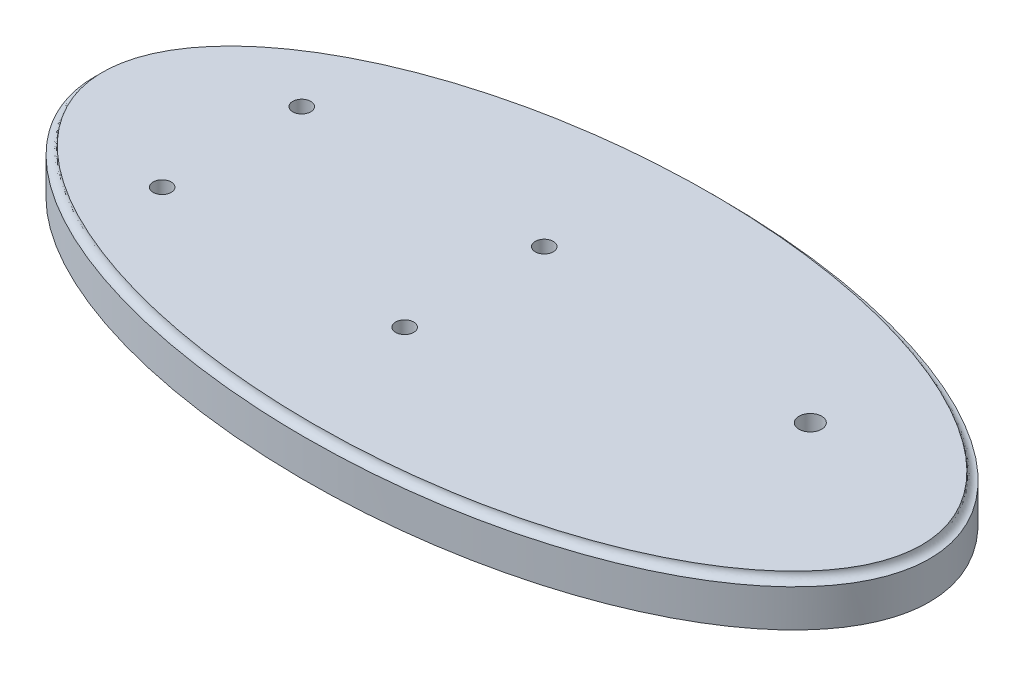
ISO-10303-21;
HEADER;
FILE_DESCRIPTION(('STEP AP214'),'2;1');
FILE_NAME('part.step','',(''),(''),'','','');
FILE_SCHEMA(('AUTOMOTIVE_DESIGN { 1 0 10303 214 1 1 1 1 }'));
ENDSEC;
DATA;
#1=APPLICATION_CONTEXT('core data for automotive mechanical design processes');
#2=APPLICATION_PROTOCOL_DEFINITION('international standard','automotive_design',2000,#1);
#3=PRODUCT_CONTEXT('',#1,'mechanical');
#4=PRODUCT('Part','Part','',(#3));
#5=PRODUCT_RELATED_PRODUCT_CATEGORY('part','',(#4));
#6=PRODUCT_DEFINITION_FORMATION('','',#4);
#7=PRODUCT_DEFINITION_CONTEXT('part definition',#1,'design');
#8=PRODUCT_DEFINITION('design','',#6,#7);
#9=PRODUCT_DEFINITION_SHAPE('','',#8);
#10=(LENGTH_UNIT() NAMED_UNIT(*) SI_UNIT(.MILLI.,.METRE.));
#11=(NAMED_UNIT(*) PLANE_ANGLE_UNIT() SI_UNIT($,.RADIAN.));
#12=(NAMED_UNIT(*) SI_UNIT($,.STERADIAN.) SOLID_ANGLE_UNIT());
#13=UNCERTAINTY_MEASURE_WITH_UNIT(LENGTH_MEASURE(1.E-05),#10,'distance_accuracy_value','');
#14=(GEOMETRIC_REPRESENTATION_CONTEXT(3) GLOBAL_UNCERTAINTY_ASSIGNED_CONTEXT((#13)) GLOBAL_UNIT_ASSIGNED_CONTEXT((#10,
#11,#12)) REPRESENTATION_CONTEXT('',''));
#15=CARTESIAN_POINT('',(0.,0.,0.));
#16=DIRECTION('',(0.,0.,1.));
#17=DIRECTION('',(1.,0.,0.));
#18=AXIS2_PLACEMENT_3D('',#15,#16,#17);
#19=CARTESIAN_POINT('',(0.,-10.,0.));
#20=DIRECTION('',(0.,1.,0.));
#21=DIRECTION('',(1.,0.,0.));
#22=AXIS2_PLACEMENT_3D('',#19,#20,#21);
#23=ELLIPSE('',#22,92.1,45.7);
#24=DIRECTION('',(0.,1.,0.));
#25=VECTOR('',#24,1.);
#26=SURFACE_OF_LINEAR_EXTRUSION('',#23,#25);
#27=CARTESIAN_POINT('',(92.1,-1.75,0.));
#28=CARTESIAN_POINT('',(92.0999964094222,-1.74999999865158,-0.58544822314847));
#29=CARTESIAN_POINT('',(92.0772875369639,-1.7499999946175,-1.17093820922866));
#30=CARTESIAN_POINT('',(91.9868644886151,-1.74999999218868,-2.33870428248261));
#31=CARTESIAN_POINT('',(91.9191265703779,-1.74999999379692,-2.92097851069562));
#32=CARTESIAN_POINT('',(91.7391182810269,-1.74999999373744,-4.08386532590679));
#33=CARTESIAN_POINT('',(91.6264587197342,-1.74999999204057,-4.66441749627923));
#34=CARTESIAN_POINT('',(91.3586433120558,-1.74999999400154,-5.81576870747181));
#35=CARTESIAN_POINT('',(91.2034748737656,-1.74999999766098,-6.38656480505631));
#36=CARTESIAN_POINT('',(90.8530447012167,-1.74999999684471,-7.51645090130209));
#37=CARTESIAN_POINT('',(90.6577335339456,-1.74999999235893,-8.07552552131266));
#38=CARTESIAN_POINT('',(90.2301186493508,-1.74999999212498,-9.179281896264));
#39=CARTESIAN_POINT('',(89.9978128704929,-1.74999999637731,-9.72396284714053));
#40=CARTESIAN_POINT('',(89.359268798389,-1.7500000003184,-11.0990820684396));
#41=CARTESIAN_POINT('',(88.9286061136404,-1.74999999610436,-11.9182567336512));
#42=CARTESIAN_POINT('',(87.9962674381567,-1.7499999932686,-13.5152090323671));
#43=CARTESIAN_POINT('',(87.4945560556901,-1.74999999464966,-14.2929657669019));
#44=CARTESIAN_POINT('',(86.4299144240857,-1.74999999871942,-15.8076704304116));
#45=CARTESIAN_POINT('',(85.8668543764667,-1.75000000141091,-16.5445266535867));
#46=CARTESIAN_POINT('',(84.6899558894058,-1.74999999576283,-17.9761976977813));
#47=CARTESIAN_POINT('',(84.0761192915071,-1.74999998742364,-18.6710140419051));
#48=CARTESIAN_POINT('',(82.7498519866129,-1.74999998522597,-20.0794656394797));
#49=CARTESIAN_POINT('',(82.0334970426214,-1.74999999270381,-20.7893929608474));
#50=CARTESIAN_POINT('',(80.5583076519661,-1.7499999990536,-22.1642725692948));
#51=CARTESIAN_POINT('',(79.7994490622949,-1.74999999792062,-22.8291988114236));
#52=CARTESIAN_POINT('',(78.2463415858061,-1.74999999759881,-24.1165667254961));
#53=CARTESIAN_POINT('',(77.4520843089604,-1.74999999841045,-24.73899823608));
#54=CARTESIAN_POINT('',(75.8328478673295,-1.74999999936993,-25.9447664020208));
#55=CARTESIAN_POINT('',(75.0078282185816,-1.74999999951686,-26.5280484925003));
#56=CARTESIAN_POINT('',(73.332914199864,-1.74999999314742,-27.6570226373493));
#57=CARTESIAN_POINT('',(72.4830278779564,-1.74999998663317,-28.2027266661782));
#58=CARTESIAN_POINT('',(70.7619133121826,-1.74999998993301,-29.2591081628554));
#59=CARTESIAN_POINT('',(69.8906864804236,-1.74999999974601,-29.7697879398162));
#60=CARTESIAN_POINT('',(67.7755701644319,-1.74999999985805,-30.9572996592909));
#61=CARTESIAN_POINT('',(66.5227840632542,-1.74999998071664,-31.6183073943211));
#62=CARTESIAN_POINT('',(63.9879103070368,-1.74999997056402,-32.8811727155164));
#63=CARTESIAN_POINT('',(62.7058224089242,-1.74999997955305,-33.4830298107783));
#64=CARTESIAN_POINT('',(60.1192226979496,-1.74999997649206,-34.6313904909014));
#65=CARTESIAN_POINT('',(58.8147432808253,-1.74999996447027,-35.1779672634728));
#66=CARTESIAN_POINT('',(56.1858038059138,-1.74999993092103,-36.2205334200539));
#67=CARTESIAN_POINT('',(54.8613439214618,-1.74999990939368,-36.7165232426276));
#68=CARTESIAN_POINT('',(52.1983861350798,-1.74999988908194,-37.6602560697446));
#69=CARTESIAN_POINT('',(50.8599217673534,-1.74999989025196,-38.1080939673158));
#70=CARTESIAN_POINT('',(48.1690047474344,-1.74999989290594,-38.959434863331));
#71=CARTESIAN_POINT('',(46.816552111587,-1.74999989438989,-39.3629379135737));
#72=CARTESIAN_POINT('',(44.0995347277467,-1.74999986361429,-40.1280584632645));
#73=CARTESIAN_POINT('',(42.7349672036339,-1.7499998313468,-40.4896660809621));
#74=CARTESIAN_POINT('',(39.9958805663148,-1.74999974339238,-41.1728898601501));
#75=CARTESIAN_POINT('',(38.6213614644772,-1.74999968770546,-41.4945060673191));
#76=CARTESIAN_POINT('',(35.8652813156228,-1.74999966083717,-42.0991508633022));
#77=CARTESIAN_POINT('',(34.4837284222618,-1.74999968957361,-42.3822166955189));
#78=CARTESIAN_POINT('',(31.7136066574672,-1.74999971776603,-42.9115568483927));
#79=CARTESIAN_POINT('',(30.3250377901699,-1.74999971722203,-43.1578311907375));
#80=CARTESIAN_POINT('',(27.5422124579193,-1.74999961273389,-43.6147592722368));
#81=CARTESIAN_POINT('',(26.147956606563,-1.74999950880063,-43.8254167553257));
#82=CARTESIAN_POINT('',(23.3546634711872,-1.74999916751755,-44.2121305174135));
#83=CARTESIAN_POINT('',(21.9556261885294,-1.74999893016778,-44.3881868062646));
#84=CARTESIAN_POINT('',(19.1541736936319,-1.74999868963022,-44.7064488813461));
#85=CARTESIAN_POINT('',(17.7517597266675,-1.74999868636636,-44.8486656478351));
#86=CARTESIAN_POINT('',(14.9439235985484,-1.74999892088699,-45.0999591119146));
#87=CARTESIAN_POINT('',(13.5385013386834,-1.7499991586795,-45.2090347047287));
#88=CARTESIAN_POINT('',(10.7255237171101,-1.74999955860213,-45.3945144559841));
#89=CARTESIAN_POINT('',(9.31796838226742,-1.7499997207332,-45.4709190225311));
#90=CARTESIAN_POINT('',(6.50142520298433,-1.74999992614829,-45.5913898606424));
#91=CARTESIAN_POINT('',(5.09243730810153,-1.74999996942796,-45.6354549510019));
#92=CARTESIAN_POINT('',(2.27392440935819,-1.75000000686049,-45.6914283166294));
#93=CARTESIAN_POINT('',(0.864399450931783,-1.75000000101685,-45.703338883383));
#94=CARTESIAN_POINT('',(-1.95450640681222,-1.74999999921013,-45.695060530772));
#95=CARTESIAN_POINT('',(-3.36388730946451,-1.75000000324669,-45.6748727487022));
#96=CARTESIAN_POINT('',(-6.18182336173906,-1.7499999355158,-45.6023139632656));
#97=CARTESIAN_POINT('',(-7.59037851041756,-1.74999986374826,-45.5499429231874));
#98=CARTESIAN_POINT('',(-10.4058695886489,-1.74999960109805,-45.4127958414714));
#99=CARTESIAN_POINT('',(-11.8128055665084,-1.74999941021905,-45.3280207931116));
#100=CARTESIAN_POINT('',(-14.6244886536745,-1.74999899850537,-45.1256876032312));
#101=CARTESIAN_POINT('',(-16.0292354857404,-1.74999877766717,-45.0081256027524));
#102=CARTESIAN_POINT('',(-18.8355517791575,-1.74999866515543,-44.7397070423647));
#103=CARTESIAN_POINT('',(-20.2371212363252,-1.74999877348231,-44.5888504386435));
#104=CARTESIAN_POINT('',(-23.0363661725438,-1.7499990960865,-44.2531472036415));
#105=CARTESIAN_POINT('',(-24.4340411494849,-1.74999931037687,-44.0682963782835));
#106=CARTESIAN_POINT('',(-27.2243457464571,-1.74999959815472,-43.6637698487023));
#107=CARTESIAN_POINT('',(-28.6169753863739,-1.74999967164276,-43.4440942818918));
#108=CARTESIAN_POINT('',(-31.3969245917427,-1.749999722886,-42.9687407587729));
#109=CARTESIAN_POINT('',(-32.7842405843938,-1.74999970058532,-42.7130418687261));
#110=CARTESIAN_POINT('',(-35.5515442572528,-1.74999967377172,-42.1644808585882));
#111=CARTESIAN_POINT('',(-36.9315318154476,-1.7499996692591,-41.8716181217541));
#112=CARTESIAN_POINT('',(-39.6822993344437,-1.74999972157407,-41.2473418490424));
#113=CARTESIAN_POINT('',(-41.0530821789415,-1.74999977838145,-40.9159410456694));
#114=CARTESIAN_POINT('',(-43.7841923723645,-1.74999985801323,-40.2127641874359));
#115=CARTESIAN_POINT('',(-45.1445203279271,-1.74999988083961,-39.8409904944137));
#116=CARTESIAN_POINT('',(-47.8512024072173,-1.7499998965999,-39.0554546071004));
#117=CARTESIAN_POINT('',(-49.1975717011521,-1.74999988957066,-38.641744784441));
#118=CARTESIAN_POINT('',(-51.8761017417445,-1.74999988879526,-37.7694009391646));
#119=CARTESIAN_POINT('',(-53.2082589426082,-1.74999989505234,-37.3107559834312));
#120=CARTESIAN_POINT('',(-55.5115429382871,-1.74999991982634,-36.4710431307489));
#121=CARTESIAN_POINT('',(-56.4866056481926,-1.74999993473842,-36.1007504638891));
#122=CARTESIAN_POINT('',(-58.4258919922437,-1.7499999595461,-35.3326464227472));
#123=CARTESIAN_POINT('',(-59.3901153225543,-1.74999996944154,-34.9348342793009));
#124=CARTESIAN_POINT('',(-61.3055092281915,-1.74999997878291,-34.1104449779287));
#125=CARTESIAN_POINT('',(-62.2566873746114,-1.74999997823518,-33.683885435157));
#126=CARTESIAN_POINT('',(-64.1446901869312,-1.74999997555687,-32.8000933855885));
#127=CARTESIAN_POINT('',(-65.0815153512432,-1.74999997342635,-32.3428619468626));
#128=CARTESIAN_POINT('',(-66.730922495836,-1.74999998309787,-31.5017008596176));
#129=CARTESIAN_POINT('',(-67.4468070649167,-1.74999999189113,-31.1242409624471));
#130=CARTESIAN_POINT('',(-68.8673016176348,-1.74999999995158,-30.3486918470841));
#131=CARTESIAN_POINT('',(-69.5719120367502,-1.74999999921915,-29.9506034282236));
#132=CARTESIAN_POINT('',(-70.9698625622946,-1.74999999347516,-29.1318728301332));
#133=CARTESIAN_POINT('',(-71.6631766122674,-1.74999998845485,-28.7111861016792));
#134=CARTESIAN_POINT('',(-73.0354261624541,-1.74999998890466,-27.8467838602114));
#135=CARTESIAN_POINT('',(-73.7143603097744,-1.74999999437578,-27.4030661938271));
#136=CARTESIAN_POINT('',(-74.9247886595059,-1.74999999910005,-26.5803980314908));
#137=CARTESIAN_POINT('',(-75.4591868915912,-1.74999999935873,-26.2057182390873));
#138=CARTESIAN_POINT('',(-76.5160962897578,-1.74999999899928,-25.4399634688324));
#139=CARTESIAN_POINT('',(-77.0386078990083,-1.74999999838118,-25.0488891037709));
#140=CARTESIAN_POINT('',(-78.0706263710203,-1.74999999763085,-24.2494157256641));
#141=CARTESIAN_POINT('',(-78.5801269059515,-1.74999999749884,-23.8410085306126));
#142=CARTESIAN_POINT('',(-79.5842276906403,-1.74999999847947,-23.0063398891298));
#143=CARTESIAN_POINT('',(-80.0788292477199,-1.74999999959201,-22.5800800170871));
#144=CARTESIAN_POINT('',(-81.0496269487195,-1.74999999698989,-21.7104708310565));
#145=CARTESIAN_POINT('',(-81.525883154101,-1.74999999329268,-21.2671888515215));
#146=CARTESIAN_POINT('',(-82.4597381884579,-1.74999998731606,-20.3614474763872));
#147=CARTESIAN_POINT('',(-82.917335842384,-1.74999998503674,-19.8989868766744));
#148=CARTESIAN_POINT('',(-84.2579722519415,-1.74999998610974,-18.4825009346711));
#149=CARTESIAN_POINT('',(-85.1100806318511,-1.74999999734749,-17.498286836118));
#150=CARTESIAN_POINT('',(-86.1451022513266,-1.74999999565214,-16.1692754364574));
#151=CARTESIAN_POINT('',(-86.3769616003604,-1.74999999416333,-15.8619081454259));
#152=CARTESIAN_POINT('',(-86.8306168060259,-1.74999999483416,-15.2398640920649));
#153=CARTESIAN_POINT('',(-87.0524141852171,-1.74999999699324,-14.9251884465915));
#154=CARTESIAN_POINT('',(-87.4855433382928,-1.7499999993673,-14.2880502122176));
#155=CARTESIAN_POINT('',(-87.6968596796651,-1.74999999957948,-13.9655771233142));
#156=CARTESIAN_POINT('',(-88.1079536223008,-1.74999999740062,-13.3132631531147));
#157=CARTESIAN_POINT('',(-88.3077283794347,-1.74999999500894,-12.9834204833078));
#158=CARTESIAN_POINT('',(-88.8946536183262,-1.74999999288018,-11.9724002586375));
#159=CARTESIAN_POINT('',(-89.2624794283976,-1.74999999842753,-11.2798351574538));
#160=CARTESIAN_POINT('',(-89.9398927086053,-1.7499999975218,-9.86636827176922));
#161=CARTESIAN_POINT('',(-90.2494668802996,-1.74999999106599,-9.14546006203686));
#162=CARTESIAN_POINT('',(-90.6645249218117,-1.74999999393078,-8.04577594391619));
#163=CARTESIAN_POINT('',(-90.7946553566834,-1.74999999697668,-7.67617904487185));
#164=CARTESIAN_POINT('',(-91.0376679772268,-1.74999999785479,-6.93137447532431));
#165=CARTESIAN_POINT('',(-91.1505522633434,-1.74999999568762,-6.55616749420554));
#166=CARTESIAN_POINT('',(-91.3582721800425,-1.74999999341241,-5.80079125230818));
#167=CARTESIAN_POINT('',(-91.453108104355,-1.74999999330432,-5.42062207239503));
#168=CARTESIAN_POINT('',(-91.6240098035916,-1.74999999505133,-4.65613023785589));
#169=CARTESIAN_POINT('',(-91.7000774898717,-1.74999999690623,-4.27180801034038));
#170=CARTESIAN_POINT('',(-91.8511414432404,-1.74999999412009,-3.39341282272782));
#171=CARTESIAN_POINT('',(-91.9200660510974,-1.74999998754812,-2.8982806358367));
#172=CARTESIAN_POINT('',(-92.0254485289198,-1.74999998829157,-1.90455561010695));
#173=CARTESIAN_POINT('',(-92.0619049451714,-1.74999999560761,-1.40596261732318));
#174=CARTESIAN_POINT('',(-92.1018362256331,-1.75000000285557,-0.407471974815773));
#175=CARTESIAN_POINT('',(-92.1053126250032,-1.75000000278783,0.0924256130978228));
#176=CARTESIAN_POINT('',(-92.0792414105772,-1.74999999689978,1.09120119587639));
#177=CARTESIAN_POINT('',(-92.0497038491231,-1.74999999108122,1.59007945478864));
#178=CARTESIAN_POINT('',(-91.9580349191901,-1.7499999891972,2.58484754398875));
#179=CARTESIAN_POINT('',(-91.895902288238,-1.74999999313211,3.08073725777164));
#180=CARTESIAN_POINT('',(-91.7399168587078,-1.74999999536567,4.06739781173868));
#181=CARTESIAN_POINT('',(-91.646068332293,-1.74999999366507,4.55816933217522));
#182=CARTESIAN_POINT('',(-91.3961733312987,-1.74999999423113,5.67437552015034));
#183=CARTESIAN_POINT('',(-91.2299804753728,-1.74999999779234,6.29755688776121));
#184=CARTESIAN_POINT('',(-90.8501618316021,-1.74999999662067,7.52908168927));
#185=CARTESIAN_POINT('',(-90.6365427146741,-1.74999999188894,8.13742719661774));
#186=CARTESIAN_POINT('',(-90.1655811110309,-1.74999999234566,9.3372048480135));
#187=CARTESIAN_POINT('',(-89.9082195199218,-1.74999999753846,9.92862946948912));
#188=CARTESIAN_POINT('',(-89.3538671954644,-1.74999999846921,11.0925876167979));
#189=CARTESIAN_POINT('',(-89.0568703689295,-1.74999999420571,11.6651182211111));
#190=CARTESIAN_POINT('',(-88.2445750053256,-1.7499999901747,13.1165839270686));
#191=CARTESIAN_POINT('',(-87.7025649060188,-1.74999999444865,13.9806522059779));
#192=CARTESIAN_POINT('',(-86.5441838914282,-1.75000000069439,15.6575171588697));
#193=CARTESIAN_POINT('',(-85.9277706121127,-1.75000000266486,16.4702842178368));
#194=CARTESIAN_POINT('',(-84.632601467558,-1.74999999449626,18.0461069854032));
#195=CARTESIAN_POINT('',(-83.9537615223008,-1.74999998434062,18.8090932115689));
#196=CARTESIAN_POINT('',(-82.5453198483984,-1.74999998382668,20.2859580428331));
#197=CARTESIAN_POINT('',(-81.8157325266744,-1.74999999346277,20.9998504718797));
#198=CARTESIAN_POINT('',(-80.2800904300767,-1.75000000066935,22.4129216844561));
#199=CARTESIAN_POINT('',(-79.4720666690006,-1.74999999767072,23.1099519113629));
#200=CARTESIAN_POINT('',(-77.8190237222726,-1.74999999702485,24.4557936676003));
#201=CARTESIAN_POINT('',(-76.9740622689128,-1.74999999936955,25.1046764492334));
#202=CARTESIAN_POINT('',(-75.2630691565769,-1.74999999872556,26.3507773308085));
#203=CARTESIAN_POINT('',(-74.3974317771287,-1.74999999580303,26.9485389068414));
#204=CARTESIAN_POINT('',(-72.6398958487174,-1.74999999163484,28.1042943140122));
#205=CARTESIAN_POINT('',(-71.7479932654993,-1.74999999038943,28.6622819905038));
#206=CARTESIAN_POINT('',(-69.9409875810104,-1.74999999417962,29.7416607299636));
#207=CARTESIAN_POINT('',(-69.0258590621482,-1.74999999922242,30.263009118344));
#208=CARTESIAN_POINT('',(-67.1766744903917,-1.7499999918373,31.2707854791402));
#209=CARTESIAN_POINT('',(-66.2426193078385,-1.7499999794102,31.7572150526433));
#210=CARTESIAN_POINT('',(-64.3608586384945,-1.74999997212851,32.6960073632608));
#211=CARTESIAN_POINT('',(-63.4131988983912,-1.74999997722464,33.1484620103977));
#212=CARTESIAN_POINT('',(-61.5038585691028,-1.74999997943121,34.0227107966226));
#213=CARTESIAN_POINT('',(-60.5421778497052,-1.74999997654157,34.4445046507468));
#214=CARTESIAN_POINT('',(-58.6070572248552,-1.74999996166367,35.2589375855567));
#215=CARTESIAN_POINT('',(-57.6336225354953,-1.7499999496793,35.6515890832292));
#216=CARTESIAN_POINT('',(-55.6761430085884,-1.74999992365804,36.4094282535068));
#217=CARTESIAN_POINT('',(-54.6920982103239,-1.74999990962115,36.7746160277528));
#218=CARTESIAN_POINT('',(-52.7154821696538,-1.74999989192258,37.4785798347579));
#219=CARTESIAN_POINT('',(-51.7229181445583,-1.74999988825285,37.817376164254));
#220=CARTESIAN_POINT('',(-49.7296416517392,-1.7499998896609,38.4700414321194));
#221=CARTESIAN_POINT('',(-48.728929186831,-1.74999989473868,38.7839103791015));
#222=CARTESIAN_POINT('',(-46.7203206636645,-1.74999989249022,39.3877642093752));
#223=CARTESIAN_POINT('',(-45.7124245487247,-1.7499998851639,39.6777489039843));
#224=CARTESIAN_POINT('',(-43.6902942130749,-1.74999985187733,40.2347506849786));
#225=CARTESIAN_POINT('',(-42.676059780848,-1.74999982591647,40.5017670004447));
#226=CARTESIAN_POINT('',(-39.6261594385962,-1.74999973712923,41.2693151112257));
#227=CARTESIAN_POINT('',(-37.5820726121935,-1.74999966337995,41.7367113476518));
#228=CARTESIAN_POINT('',(-33.4765280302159,-1.74999967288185,42.5885187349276));
#229=CARTESIAN_POINT('',(-31.4150677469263,-1.7499997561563,42.9729175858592));
#230=CARTESIAN_POINT('',(-27.2744431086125,-1.74999960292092,43.6635948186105));
#231=CARTESIAN_POINT('',(-25.1952496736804,-1.74999936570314,43.9696984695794));
#232=CARTESIAN_POINT('',(-21.0269095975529,-1.74999889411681,44.5058702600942));
#233=CARTESIAN_POINT('',(-18.9377619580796,-1.74999865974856,44.7359306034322));
#234=CARTESIAN_POINT('',(-14.7526324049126,-1.7499988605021,45.1222707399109));
#235=CARTESIAN_POINT('',(-12.6566503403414,-1.74999929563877,45.2785488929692));
#236=CARTESIAN_POINT('',(-8.46073406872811,-1.74999983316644,45.5188203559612));
#237=CARTESIAN_POINT('',(-6.36080019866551,-1.74999993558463,45.6028195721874));
#238=CARTESIAN_POINT('',(-2.1649285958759,-1.75000002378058,45.6992240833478));
#239=CARTESIAN_POINT('',(-0.0689952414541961,-1.75000000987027,45.7118206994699));
#240=CARTESIAN_POINT('',(4.12213344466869,-1.74999998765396,45.6660497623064));
#241=CARTESIAN_POINT('',(6.21732876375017,-1.74999997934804,45.6076810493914));
#242=CARTESIAN_POINT('',(10.4099517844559,-1.74999960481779,45.4191832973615));
#243=CARTESIAN_POINT('',(12.5073711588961,-1.74999923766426,45.288868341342));
#244=CARTESIAN_POINT('',(16.6965804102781,-1.74999878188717,44.9550848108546));
#245=CARTESIAN_POINT('',(18.78836979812,-1.74999869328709,44.7516100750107));
#246=CARTESIAN_POINT('',(22.9632222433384,-1.74999899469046,44.2695137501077));
#247=CARTESIAN_POINT('',(25.0462856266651,-1.74999938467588,43.9908949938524));
#248=CARTESIAN_POINT('',(29.2003112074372,-1.74999974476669,43.3556965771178));
#249=CARTESIAN_POINT('',(31.2712747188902,-1.74999971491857,42.9991255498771));
#250=CARTESIAN_POINT('',(35.3932228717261,-1.74999968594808,42.2050161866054));
#251=CARTESIAN_POINT('',(37.4442399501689,-1.74999968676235,41.7676466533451));
#252=CARTESIAN_POINT('',(41.5257036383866,-1.74999976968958,40.8065990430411));
#253=CARTESIAN_POINT('',(43.5561543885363,-1.74999985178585,40.2829387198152));
#254=CARTESIAN_POINT('',(46.5825883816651,-1.7499998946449,39.4278093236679));
#255=CARTESIAN_POINT('',(47.5884718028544,-1.74999989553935,39.1310668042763));
#256=CARTESIAN_POINT('',(49.5927762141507,-1.74999989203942,38.5134105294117));
#257=CARTESIAN_POINT('',(50.5911974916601,-1.74999988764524,38.1924977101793));
#258=CARTESIAN_POINT('',(52.5797897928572,-1.7499998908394,37.5253574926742));
#259=CARTESIAN_POINT('',(53.5699590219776,-1.74999989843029,37.1791247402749));
#260=CARTESIAN_POINT('',(55.5406523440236,-1.74999992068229,36.460190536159));
#261=CARTESIAN_POINT('',(56.5211764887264,-1.74999993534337,36.0874892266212));
#262=CARTESIAN_POINT('',(58.4722615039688,-1.74999995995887,35.3138305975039));
#263=CARTESIAN_POINT('',(59.4428104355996,-1.74999996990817,34.9128431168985));
#264=CARTESIAN_POINT('',(61.3712635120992,-1.74999997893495,34.0814118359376));
#265=CARTESIAN_POINT('',(62.3291673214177,-1.74999997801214,33.6509672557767));
#266=CARTESIAN_POINT('',(64.2301155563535,-1.74999997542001,32.7590071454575));
#267=CARTESIAN_POINT('',(65.1731638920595,-1.74999997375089,32.2974999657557));
#268=CARTESIAN_POINT('',(67.0422671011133,-1.74999998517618,31.3413937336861));
#269=CARTESIAN_POINT('',(67.9683235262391,-1.74999999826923,30.8467977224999));
#270=CARTESIAN_POINT('',(69.7996389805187,-1.75000000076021,29.8228914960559));
#271=CARTESIAN_POINT('',(70.7049214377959,-1.7499999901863,29.2936232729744));
#272=CARTESIAN_POINT('',(72.4920974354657,-1.74999998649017,28.1976128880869));
#273=CARTESIAN_POINT('',(73.3740005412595,-1.74999999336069,27.6308863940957));
#274=CARTESIAN_POINT('',(74.8575203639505,-1.7499999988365,26.6281445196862));
#275=CARTESIAN_POINT('',(75.4659288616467,-1.74999999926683,26.2021610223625));
#276=CARTESIAN_POINT('',(76.6672960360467,-1.74999999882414,25.328901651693));
#277=CARTESIAN_POINT('',(77.2602549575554,-1.74999999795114,24.881626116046));
#278=CARTESIAN_POINT('',(78.4300031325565,-1.74999999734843,23.9636502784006));
#279=CARTESIAN_POINT('',(79.0067518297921,-1.74999999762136,23.492898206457));
#280=CARTESIAN_POINT('',(80.1403129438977,-1.7499999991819,22.5277304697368));
#281=CARTESIAN_POINT('',(80.6971221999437,-1.75000000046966,22.0333110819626));
#282=CARTESIAN_POINT('',(81.6668479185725,-1.74999999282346,21.1322123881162));
#283=CARTESIAN_POINT('',(82.0842835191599,-1.74999998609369,20.7304004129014));
#284=CARTESIAN_POINT('',(82.9037293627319,-1.74999998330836,19.9113473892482));
#285=CARTESIAN_POINT('',(83.3057384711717,-1.74999998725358,19.4941052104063));
#286=CARTESIAN_POINT('',(84.4864363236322,-1.74999999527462,18.2181113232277));
#287=CARTESIAN_POINT('',(85.239661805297,-1.74999999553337,17.3352152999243));
#288=CARTESIAN_POINT('',(86.3045573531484,-1.7499999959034,15.9627250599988));
#289=CARTESIAN_POINT('',(86.6483385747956,-1.7499999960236,15.4977693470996));
#290=CARTESIAN_POINT('',(87.3123996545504,-1.74999999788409,14.5512207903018));
#291=CARTESIAN_POINT('',(87.6326778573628,-1.74999999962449,14.0696267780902));
#292=CARTESIAN_POINT('',(88.2468372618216,-1.74999999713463,13.0903938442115));
#293=CARTESIAN_POINT('',(88.540738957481,-1.74999999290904,12.5927677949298));
#294=CARTESIAN_POINT('',(89.0996057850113,-1.74999999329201,11.5816248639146));
#295=CARTESIAN_POINT('',(89.3645785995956,-1.74999999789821,11.0681122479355));
#296=CARTESIAN_POINT('',(89.812030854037,-1.74999999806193,10.1320539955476));
#297=CARTESIAN_POINT('',(90.0003206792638,-1.74999999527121,9.71228041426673));
#298=CARTESIAN_POINT('',(90.3552915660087,-1.74999999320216,8.86371335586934));
#299=CARTESIAN_POINT('',(90.5219747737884,-1.74999999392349,8.43492077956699));
#300=CARTESIAN_POINT('',(90.8323278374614,-1.7499999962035,7.56901785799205));
#301=CARTESIAN_POINT('',(90.9759951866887,-1.74999999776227,7.13190661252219));
#302=CARTESIAN_POINT('',(91.2386066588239,-1.74999999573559,6.25150282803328));
#303=CARTESIAN_POINT('',(91.3576123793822,-1.74999999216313,5.80822871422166));
#304=CARTESIAN_POINT('',(91.5701348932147,-1.74999999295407,4.9156494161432));
#305=CARTESIAN_POINT('',(91.6636541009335,-1.74999999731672,4.46634480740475));
#306=CARTESIAN_POINT('',(91.8241561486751,-1.74999999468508,3.56325768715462));
#307=CARTESIAN_POINT('',(91.8911550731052,-1.74999998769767,3.10947806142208));
#308=CARTESIAN_POINT('',(91.9703623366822,-1.749999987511,2.43392470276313));
#309=CARTESIAN_POINT('',(91.9929992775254,-1.74999998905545,2.2133310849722));
#310=CARTESIAN_POINT('',(92.0318473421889,-1.74999999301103,1.77161432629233));
#311=CARTESIAN_POINT('',(92.0480595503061,-1.74999999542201,1.55049128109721));
#312=CARTESIAN_POINT('',(92.0869851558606,-1.75000000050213,0.886652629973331));
#313=CARTESIAN_POINT('',(92.1000027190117,-1.75000000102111,0.443338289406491));
#314=CARTESIAN_POINT('',(92.1,-1.75,0.));
#315=B_SPLINE_CURVE_WITH_KNOTS('',3,(#27,#28,#29,#30,#31,#32,#33,#34,#35,#36,#37,#38,#39,#40,
#41,#42,#43,#44,#45,#46,#47,#48,#49,#50,#51,#52,#53,#54,#55,#56,#57,#58,#59,#60,#61,#62,#63,#64,
#65,#66,#67,#68,#69,#70,#71,#72,#73,#74,#75,#76,#77,#78,#79,#80,#81,#82,#83,#84,#85,#86,#87,#88,
#89,#90,#91,#92,#93,#94,#95,#96,#97,#98,#99,#100,#101,#102,#103,#104,#105,#106,#107,#108,#109,
#110,#111,#112,#113,#114,#115,#116,#117,#118,#119,#120,#121,#122,#123,#124,#125,#126,#127,#128,
#129,#130,#131,#132,#133,#134,#135,#136,#137,#138,#139,#140,#141,#142,#143,#144,#145,#146,#147,
#148,#149,#150,#151,#152,#153,#154,#155,#156,#157,#158,#159,#160,#161,#162,#163,#164,#165,#166,
#167,#168,#169,#170,#171,#172,#173,#174,#175,#176,#177,#178,#179,#180,#181,#182,#183,#184,#185,
#186,#187,#188,#189,#190,#191,#192,#193,#194,#195,#196,#197,#198,#199,#200,#201,#202,#203,#204,
#205,#206,#207,#208,#209,#210,#211,#212,#213,#214,#215,#216,#217,#218,#219,#220,#221,#222,#223,
#224,#225,#226,#227,#228,#229,#230,#231,#232,#233,#234,#235,#236,#237,#238,#239,#240,#241,#242,
#243,#244,#245,#246,#247,#248,#249,#250,#251,#252,#253,#254,#255,#256,#257,#258,#259,#260,#261,
#262,#263,#264,#265,#266,#267,#268,#269,#270,#271,#272,#273,#274,#275,#276,#277,#278,#279,#280,
#281,#282,#283,#284,#285,#286,#287,#288,#289,#290,#291,#292,#293,#294,#295,#296,#297,#298,#299,
#300,#301,#302,#303,#304,#305,#306,#307,#308,#309,#310,#311,#312,#313,#314),.UNSPECIFIED.,.T.,
.F.,(4,2,2,2,2,2,2,2,2,2,2,2,2,2,2,2,2,2,2,2,2,2,2,2,2,2,2,2,2,2,2,2,2,2,2,2,2,2,2,2,2,2,2,2,2,
2,2,2,2,2,2,2,2,2,2,2,2,2,2,2,2,2,2,2,2,2,2,2,2,2,2,2,2,2,2,2,2,2,2,2,2,2,2,2,2,2,2,2,2,2,2,2,2,
2,2,2,2,2,2,2,2,2,2,2,2,2,2,2,2,2,2,2,2,2,2,2,2,2,2,2,2,2,2,2,2,2,2,2,2,2,2,2,2,2,2,2,2,2,2,2,2,
2,2,4),(0.,1.75598096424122,3.51288853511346,5.285360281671,7.05835763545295,8.83355153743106,
10.6088443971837,13.3808993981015,16.1543401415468,18.9337671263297,21.7130933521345,
24.7365522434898,27.7617462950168,30.7876612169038,33.817709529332,36.8467877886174,
39.8756661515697,44.1232615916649,48.3708922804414,52.6128236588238,56.8547182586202,
61.0880939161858,65.3214646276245,69.555831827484,73.7901941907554,78.0204362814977,
82.250675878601,86.4804705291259,90.7102639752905,94.9386830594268,99.167243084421,
103.395750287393,107.6244119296,111.852772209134,116.080982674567,120.309197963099,
124.537283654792,128.765867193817,132.994456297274,137.223567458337,141.45266193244,
145.684224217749,149.91585673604,154.14609512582,158.376086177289,162.600858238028,
166.826660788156,169.955309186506,173.084045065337,176.21088092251,179.33760795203,
181.76520240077,184.192702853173,186.625178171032,189.05788133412,191.015580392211,
192.973206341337,194.93176690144,196.890155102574,198.841465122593,200.792897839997,
204.69086607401,205.845776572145,207.000511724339,208.156899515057,209.313571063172,
211.663575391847,214.014115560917,215.189273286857,216.364287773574,217.539283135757,
218.71415878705,220.212792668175,221.711493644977,223.210124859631,224.708299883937,
226.206532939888,227.704564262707,229.637341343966,231.569846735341,233.503198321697,
235.436847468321,238.491916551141,241.548733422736,244.60972944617,247.669859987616,
250.869270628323,254.063847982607,257.218578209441,260.373795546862,263.532628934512,
266.691317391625,269.84112760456,272.990967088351,276.139456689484,279.287934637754,
282.433966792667,285.579997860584,288.726053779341,291.872215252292,298.160709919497,
304.450135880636,310.753477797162,317.057465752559,323.361593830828,329.665206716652,
335.951921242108,342.238738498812,348.541878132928,354.845548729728,361.148981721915,
367.451716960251,373.741430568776,380.029851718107,383.175825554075,386.32167759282,
389.468196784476,392.614699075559,395.764608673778,398.914601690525,402.063751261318,
405.212611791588,408.357726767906,411.501534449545,413.729266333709,415.956962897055,
418.189810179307,420.423009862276,422.160801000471,423.898719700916,427.375101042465,
429.109285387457,430.843591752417,432.576538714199,434.309024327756,435.688683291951,
437.068205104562,438.447877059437,439.824060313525,441.200113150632,442.575330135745,
443.240507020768,443.905571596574,445.235311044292),.UNSPECIFIED.);
#316=CARTESIAN_POINT('',(92.1,-1.75,0.));
#317=VERTEX_POINT('',#316);
#318=EDGE_CURVE('E57',#317,#317,#315,.T.);
#319=ORIENTED_EDGE('',*,*,#318,.F.);
#320=EDGE_LOOP('',(#319));
#321=FACE_BOUND('',#320,.T.);
#322=CARTESIAN_POINT('',(92.1,-10.,0.));
#323=VERTEX_POINT('',#322);
#324=EDGE_CURVE('E11',#323,#323,#23,.T.);
#325=ORIENTED_EDGE('',*,*,#324,.T.);
#326=EDGE_LOOP('',(#325));
#327=FACE_BOUND('',#326,.T.);
#328=ADVANCED_FACE('F48',(#321,#327),#26,.T.);
#329=CARTESIAN_POINT('',(0.,-10.,0.));
#330=DIRECTION('',(0.,1.,0.));
#331=DIRECTION('',(0.,0.,1.));
#332=AXIS2_PLACEMENT_3D('',#329,#330,#331);
#333=PLANE('',#332);
#334=CARTESIAN_POINT('',(54.7,-10.,-11.1));
#335=DIRECTION('',(0.,-1.,0.));
#336=DIRECTION('',(0.,0.,-1.));
#337=AXIS2_PLACEMENT_3D('',#334,#335,#336);
#338=CIRCLE('',#337,3.);
#339=CARTESIAN_POINT('',(54.7,-10.,-14.1));
#340=VERTEX_POINT('',#339);
#341=EDGE_CURVE('E206',#340,#340,#338,.T.);
#342=ORIENTED_EDGE('',*,*,#341,.F.);
#343=EDGE_LOOP('',(#342));
#344=FACE_BOUND('',#343,.T.);
#345=CARTESIAN_POINT('',(-61.8,-10.,15.4));
#346=DIRECTION('',(0.,-1.,0.));
#347=DIRECTION('',(0.,0.,-1.));
#348=AXIS2_PLACEMENT_3D('',#345,#346,#347);
#349=CIRCLE('',#348,2.5);
#350=CARTESIAN_POINT('',(-61.8,-10.,12.9));
#351=VERTEX_POINT('',#350);
#352=EDGE_CURVE('E98',#351,#351,#349,.T.);
#353=ORIENTED_EDGE('',*,*,#352,.F.);
#354=EDGE_LOOP('',(#353));
#355=FACE_BOUND('',#354,.T.);
#356=CARTESIAN_POINT('',(-61.8,-10.,-15.4));
#357=DIRECTION('',(0.,-1.,0.));
#358=DIRECTION('',(0.,0.,-1.));
#359=AXIS2_PLACEMENT_3D('',#356,#357,#358);
#360=CIRCLE('',#359,2.5);
#361=CARTESIAN_POINT('',(-61.8,-10.,-17.9));
#362=VERTEX_POINT('',#361);
#363=EDGE_CURVE('E91',#362,#362,#360,.T.);
#364=ORIENTED_EDGE('',*,*,#363,.F.);
#365=EDGE_LOOP('',(#364));
#366=FACE_BOUND('',#365,.T.);
#367=CARTESIAN_POINT('',(-8.30000000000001,-10.,-15.4));
#368=DIRECTION('',(0.,-1.,0.));
#369=DIRECTION('',(0.,0.,-1.));
#370=AXIS2_PLACEMENT_3D('',#367,#368,#369);
#371=CIRCLE('',#370,2.5);
#372=CARTESIAN_POINT('',(-8.30000000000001,-10.,-17.9));
#373=VERTEX_POINT('',#372);
#374=EDGE_CURVE('E87',#373,#373,#371,.T.);
#375=ORIENTED_EDGE('',*,*,#374,.F.);
#376=EDGE_LOOP('',(#375));
#377=FACE_BOUND('',#376,.T.);
#378=CARTESIAN_POINT('',(-8.30000000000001,-10.,15.4));
#379=DIRECTION('',(0.,-1.,0.));
#380=DIRECTION('',(0.,0.,-1.));
#381=AXIS2_PLACEMENT_3D('',#378,#379,#380);
#382=CIRCLE('',#381,2.5);
#383=CARTESIAN_POINT('',(-8.30000000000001,-10.,12.9));
#384=VERTEX_POINT('',#383);
#385=EDGE_CURVE('E83',#384,#384,#382,.T.);
#386=ORIENTED_EDGE('',*,*,#385,.F.);
#387=EDGE_LOOP('',(#386));
#388=FACE_BOUND('',#387,.T.);
#389=ORIENTED_EDGE('',*,*,#324,.F.);
#390=EDGE_LOOP('',(#389));
#391=FACE_BOUND('',#390,.T.);
#392=ADVANCED_FACE('F125',(#344,#355,#366,#377,#388,#391),#333,.F.);
#393=CARTESIAN_POINT('',(0.,0.,43.95));
#394=CARTESIAN_POINT('',(6.45945002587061,0.,43.95));
#395=CARTESIAN_POINT('',(18.9564023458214,0.,43.2736892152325));
#396=CARTESIAN_POINT('',(35.8279916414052,0.,40.5973130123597));
#397=CARTESIAN_POINT('',(50.1656770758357,0.,36.7485387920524));
#398=CARTESIAN_POINT('',(61.799348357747,0.,32.2068071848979));
#399=CARTESIAN_POINT('',(70.8635186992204,0.,27.3733859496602));
#400=CARTESIAN_POINT('',(77.3568330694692,0.,22.7646655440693));
#401=CARTESIAN_POINT('',(81.9287641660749,0.,18.5579822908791));
#402=CARTESIAN_POINT('',(85.1017912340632,0.,14.8048441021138));
#403=CARTESIAN_POINT('',(87.3456740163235,0.,11.3132024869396));
#404=CARTESIAN_POINT('',(88.851834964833,0.,8.09495665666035));
#405=CARTESIAN_POINT('',(89.7804154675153,0.,5.14302760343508));
#406=CARTESIAN_POINT('',(90.2606972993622,0.,2.44162423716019));
#407=CARTESIAN_POINT('',(90.3499999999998,0.,0.786308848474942));
#408=CARTESIAN_POINT('',(90.3500000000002,0.,-0.786308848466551));
#409=CARTESIAN_POINT('',(90.2606972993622,0.,-2.44162423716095));
#410=CARTESIAN_POINT('',(89.780415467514,0.,-5.1430276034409));
#411=CARTESIAN_POINT('',(88.8518349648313,0.,-8.09495665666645));
#412=CARTESIAN_POINT('',(87.3456740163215,0.,-11.3132024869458));
#413=CARTESIAN_POINT('',(85.101791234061,0.,-14.80484410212));
#414=CARTESIAN_POINT('',(81.9287641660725,0.,-18.5579822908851));
#415=CARTESIAN_POINT('',(77.3568330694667,0.,-22.7646655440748));
#416=CARTESIAN_POINT('',(70.8635186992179,0.,-27.373385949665));
#417=CARTESIAN_POINT('',(61.7993483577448,0.,-32.2068071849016));
#418=CARTESIAN_POINT('',(50.165677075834,0.,-36.7485387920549));
#419=CARTESIAN_POINT('',(35.8279916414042,0.,-40.5973130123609));
#420=CARTESIAN_POINT('',(18.9564023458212,0.,-43.2736892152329));
#421=CARTESIAN_POINT('',(6.45945002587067,0.,-43.95));
#422=CARTESIAN_POINT('',(-6.4594500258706,0.,-43.95));
#423=CARTESIAN_POINT('',(-18.9564023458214,0.,-43.2736892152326));
#424=CARTESIAN_POINT('',(-35.8279916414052,0.,-40.5973130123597));
#425=CARTESIAN_POINT('',(-50.1656770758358,0.,-36.7485387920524));
#426=CARTESIAN_POINT('',(-61.799348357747,0.,-32.2068071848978));
#427=CARTESIAN_POINT('',(-70.8635186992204,0.,-27.3733859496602));
#428=CARTESIAN_POINT('',(-77.3568330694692,0.,-22.7646655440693));
#429=CARTESIAN_POINT('',(-81.9287641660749,0.,-18.5579822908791));
#430=CARTESIAN_POINT('',(-85.1017912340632,0.,-14.8048441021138));
#431=CARTESIAN_POINT('',(-87.3456740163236,0.,-11.3132024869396));
#432=CARTESIAN_POINT('',(-88.851834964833,0.,-8.09495665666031));
#433=CARTESIAN_POINT('',(-89.7804154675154,0.,-5.14302760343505));
#434=CARTESIAN_POINT('',(-90.2606972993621,0.,-2.44162423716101));
#435=CARTESIAN_POINT('',(-90.35,0.,-0.786308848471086));
#436=CARTESIAN_POINT('',(-90.35,0.,0.786308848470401));
#437=CARTESIAN_POINT('',(-90.2606972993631,0.,2.44162423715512));
#438=CARTESIAN_POINT('',(-89.7804154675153,0.,5.14302760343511));
#439=CARTESIAN_POINT('',(-88.851834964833,0.,8.09495665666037));
#440=CARTESIAN_POINT('',(-87.3456740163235,0.,11.3132024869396));
#441=CARTESIAN_POINT('',(-85.1017912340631,0.,14.8048441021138));
#442=CARTESIAN_POINT('',(-81.9287641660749,0.,18.5579822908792));
#443=CARTESIAN_POINT('',(-77.3568330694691,0.,22.7646655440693));
#444=CARTESIAN_POINT('',(-70.8635186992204,0.,27.3733859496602));
#445=CARTESIAN_POINT('',(-61.7993483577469,0.,32.2068071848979));
#446=CARTESIAN_POINT('',(-50.1656770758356,0.,36.7485387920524));
#447=CARTESIAN_POINT('',(-35.827991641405,0.,40.5973130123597));
#448=CARTESIAN_POINT('',(-18.9564023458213,0.,43.2736892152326));
#449=CARTESIAN_POINT('',(-6.45945002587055,0.,43.95));
#450=CARTESIAN_POINT('',(0.,0.,43.95));
#451=CARTESIAN_POINT('',(0.,3.50000000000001,43.95));
#452=CARTESIAN_POINT('',(6.45945002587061,3.50000000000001,43.95));
#453=CARTESIAN_POINT('',(18.9564023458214,3.50000000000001,43.2736892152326));
#454=CARTESIAN_POINT('',(35.8279916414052,3.50000000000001,40.5973130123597));
#455=CARTESIAN_POINT('',(50.1656770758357,3.50000000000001,36.7485387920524));
#456=CARTESIAN_POINT('',(61.799348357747,3.50000000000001,32.2068071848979));
#457=CARTESIAN_POINT('',(70.8635186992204,3.50000000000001,27.3733859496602));
#458=CARTESIAN_POINT('',(77.3568330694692,3.50000000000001,22.7646655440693));
#459=CARTESIAN_POINT('',(81.9287641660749,3.50000000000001,18.5579822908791));
#460=CARTESIAN_POINT('',(85.1017912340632,3.50000000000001,14.8048441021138));
#461=CARTESIAN_POINT('',(87.3456740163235,3.50000000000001,11.3132024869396));
#462=CARTESIAN_POINT('',(88.851834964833,3.50000000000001,8.09495665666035));
#463=CARTESIAN_POINT('',(89.7804154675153,3.50000000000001,5.14302760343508));
#464=CARTESIAN_POINT('',(90.2606972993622,3.50000000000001,2.44162423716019));
#465=CARTESIAN_POINT('',(90.3499999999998,3.50000000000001,0.786308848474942));
#466=CARTESIAN_POINT('',(90.3500000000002,3.50000000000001,-0.786308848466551));
#467=CARTESIAN_POINT('',(90.2606972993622,3.50000000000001,-2.44162423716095));
#468=CARTESIAN_POINT('',(89.780415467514,3.50000000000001,-5.1430276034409));
#469=CARTESIAN_POINT('',(88.8518349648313,3.50000000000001,-8.09495665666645));
#470=CARTESIAN_POINT('',(87.3456740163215,3.50000000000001,-11.3132024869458));
#471=CARTESIAN_POINT('',(85.1017912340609,3.50000000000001,-14.80484410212));
#472=CARTESIAN_POINT('',(81.9287641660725,3.50000000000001,-18.5579822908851));
#473=CARTESIAN_POINT('',(77.3568330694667,3.50000000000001,-22.7646655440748));
#474=CARTESIAN_POINT('',(70.863518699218,3.50000000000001,-27.373385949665));
#475=CARTESIAN_POINT('',(61.7993483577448,3.50000000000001,-32.2068071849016));
#476=CARTESIAN_POINT('',(50.165677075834,3.50000000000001,-36.7485387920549));
#477=CARTESIAN_POINT('',(35.8279916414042,3.50000000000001,-40.5973130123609));
#478=CARTESIAN_POINT('',(18.9564023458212,3.50000000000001,-43.2736892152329));
#479=CARTESIAN_POINT('',(6.45945002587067,3.50000000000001,-43.95));
#480=CARTESIAN_POINT('',(-6.4594500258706,3.50000000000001,-43.95));
#481=CARTESIAN_POINT('',(-18.9564023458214,3.50000000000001,-43.2736892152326));
#482=CARTESIAN_POINT('',(-35.8279916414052,3.50000000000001,-40.5973130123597));
#483=CARTESIAN_POINT('',(-50.1656770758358,3.50000000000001,-36.7485387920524));
#484=CARTESIAN_POINT('',(-61.799348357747,3.50000000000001,-32.2068071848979));
#485=CARTESIAN_POINT('',(-70.8635186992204,3.50000000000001,-27.3733859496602));
#486=CARTESIAN_POINT('',(-77.3568330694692,3.50000000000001,-22.7646655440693));
#487=CARTESIAN_POINT('',(-81.9287641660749,3.50000000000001,-18.5579822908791));
#488=CARTESIAN_POINT('',(-85.1017912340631,3.50000000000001,-14.8048441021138));
#489=CARTESIAN_POINT('',(-87.3456740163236,3.50000000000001,-11.3132024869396));
#490=CARTESIAN_POINT('',(-88.851834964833,3.50000000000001,-8.0949566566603));
#491=CARTESIAN_POINT('',(-89.7804154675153,3.50000000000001,-5.14302760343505));
#492=CARTESIAN_POINT('',(-90.2606972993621,3.50000000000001,-2.44162423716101));
#493=CARTESIAN_POINT('',(-90.35,3.50000000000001,-0.786308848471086));
#494=CARTESIAN_POINT('',(-90.35,3.50000000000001,0.786308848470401));
#495=CARTESIAN_POINT('',(-90.2606972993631,3.50000000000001,2.44162423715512));
#496=CARTESIAN_POINT('',(-89.7804154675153,3.50000000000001,5.14302760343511));
#497=CARTESIAN_POINT('',(-88.851834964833,3.50000000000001,8.09495665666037));
#498=CARTESIAN_POINT('',(-87.3456740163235,3.50000000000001,11.3132024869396));
#499=CARTESIAN_POINT('',(-85.1017912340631,3.50000000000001,14.8048441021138));
#500=CARTESIAN_POINT('',(-81.9287641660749,3.50000000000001,18.5579822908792));
#501=CARTESIAN_POINT('',(-77.3568330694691,3.50000000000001,22.7646655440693));
#502=CARTESIAN_POINT('',(-70.8635186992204,3.50000000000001,27.3733859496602));
#503=CARTESIAN_POINT('',(-61.7993483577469,3.50000000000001,32.2068071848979));
#504=CARTESIAN_POINT('',(-50.1656770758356,3.50000000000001,36.7485387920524));
#505=CARTESIAN_POINT('',(-35.827991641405,3.50000000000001,40.5973130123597));
#506=CARTESIAN_POINT('',(-18.9564023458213,3.50000000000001,43.2736892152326));
#507=CARTESIAN_POINT('',(-6.45945002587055,3.50000000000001,43.95));
#508=CARTESIAN_POINT('',(0.,3.50000000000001,43.95));
#509=CARTESIAN_POINT('',(0.,3.50000000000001,47.45));
#510=CARTESIAN_POINT('',(6.58080359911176,3.50000000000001,47.45));
#511=CARTESIAN_POINT('',(19.3204630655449,3.50000000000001,46.7609159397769));
#512=CARTESIAN_POINT('',(36.5471622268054,3.50000000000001,44.0290388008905));
#513=CARTESIAN_POINT('',(51.2452278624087,3.50000000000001,40.085201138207));
#514=CARTESIAN_POINT('',(63.2478212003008,3.50000000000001,35.4017590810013));
#515=CARTESIAN_POINT('',(72.68971494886,3.50000000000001,30.3701651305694));
#516=CARTESIAN_POINT('',(79.5446597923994,3.50000000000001,25.5088175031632));
#517=CARTESIAN_POINT('',(84.4493982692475,3.50000000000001,20.9993992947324));
#518=CARTESIAN_POINT('',(87.9146255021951,3.50000000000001,16.9043961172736));
#519=CARTESIAN_POINT('',(90.4120667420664,3.50000000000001,13.0222626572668));
#520=CARTESIAN_POINT('',(92.1191552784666,3.50000000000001,9.37847687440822));
#521=CARTESIAN_POINT('',(93.1875493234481,3.50000000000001,5.9861510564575));
#522=CARTESIAN_POINT('',(93.745756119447,3.50000000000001,2.84706472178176));
#523=CARTESIAN_POINT('',(93.8499999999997,3.50000000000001,0.921455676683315));
#524=CARTESIAN_POINT('',(93.8500000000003,3.50000000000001,-0.921455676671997));
#525=CARTESIAN_POINT('',(93.7457561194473,3.50000000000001,-2.84706472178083));
#526=CARTESIAN_POINT('',(93.1875493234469,3.50000000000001,-5.98615105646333));
#527=CARTESIAN_POINT('',(92.1191552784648,3.50000000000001,-9.37847687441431));
#528=CARTESIAN_POINT('',(90.4120667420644,3.50000000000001,-13.022262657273));
#529=CARTESIAN_POINT('',(87.9146255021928,3.50000000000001,-16.9043961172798));
#530=CARTESIAN_POINT('',(84.4493982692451,3.50000000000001,-20.9993992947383));
#531=CARTESIAN_POINT('',(79.5446597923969,3.50000000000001,-25.5088175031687));
#532=CARTESIAN_POINT('',(72.6897149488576,3.50000000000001,-30.3701651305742));
#533=CARTESIAN_POINT('',(63.2478212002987,3.50000000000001,-35.401759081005));
#534=CARTESIAN_POINT('',(51.2452278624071,3.50000000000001,-40.0852011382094));
#535=CARTESIAN_POINT('',(36.5471622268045,3.50000000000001,-44.0290388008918));
#536=CARTESIAN_POINT('',(19.3204630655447,3.50000000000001,-46.7609159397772));
#537=CARTESIAN_POINT('',(6.58080359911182,3.50000000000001,-47.45));
#538=CARTESIAN_POINT('',(-6.58080359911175,3.50000000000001,-47.45));
#539=CARTESIAN_POINT('',(-19.3204630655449,3.50000000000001,-46.760915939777));
#540=CARTESIAN_POINT('',(-36.5471622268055,3.50000000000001,-44.0290388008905));
#541=CARTESIAN_POINT('',(-51.2452278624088,3.50000000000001,-40.0852011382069));
#542=CARTESIAN_POINT('',(-63.2478212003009,3.50000000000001,-35.4017590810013));
#543=CARTESIAN_POINT('',(-72.6897149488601,3.50000000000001,-30.3701651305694));
#544=CARTESIAN_POINT('',(-79.5446597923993,3.50000000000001,-25.5088175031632));
#545=CARTESIAN_POINT('',(-84.4493982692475,3.50000000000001,-20.9993992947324));
#546=CARTESIAN_POINT('',(-87.914625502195,3.50000000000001,-16.9043961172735));
#547=CARTESIAN_POINT('',(-90.4120667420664,3.50000000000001,-13.0222626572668));
#548=CARTESIAN_POINT('',(-92.1191552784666,3.50000000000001,-9.37847687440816));
#549=CARTESIAN_POINT('',(-93.1875493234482,3.50000000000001,-5.98615105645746));
#550=CARTESIAN_POINT('',(-93.7457561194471,3.50000000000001,-2.84706472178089));
#551=CARTESIAN_POINT('',(-93.85,3.50000000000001,-0.921455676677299));
#552=CARTESIAN_POINT('',(-93.85,3.50000000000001,0.921455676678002));
#553=CARTESIAN_POINT('',(-93.745756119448,3.50000000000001,2.84706472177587));
#554=CARTESIAN_POINT('',(-93.1875493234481,3.50000000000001,5.98615105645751));
#555=CARTESIAN_POINT('',(-92.1191552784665,3.50000000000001,9.37847687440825));
#556=CARTESIAN_POINT('',(-90.4120667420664,3.50000000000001,13.0222626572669));
#557=CARTESIAN_POINT('',(-87.914625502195,3.50000000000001,16.9043961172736));
#558=CARTESIAN_POINT('',(-84.4493982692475,3.50000000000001,20.9993992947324));
#559=CARTESIAN_POINT('',(-79.5446597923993,3.50000000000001,25.5088175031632));
#560=CARTESIAN_POINT('',(-72.68971494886,3.50000000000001,30.3701651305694));
#561=CARTESIAN_POINT('',(-63.2478212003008,3.50000000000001,35.4017590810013));
#562=CARTESIAN_POINT('',(-51.2452278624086,3.50000000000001,40.085201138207));
#563=CARTESIAN_POINT('',(-36.5471622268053,3.50000000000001,44.0290388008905));
#564=CARTESIAN_POINT('',(-19.3204630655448,3.50000000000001,46.760915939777));
#565=CARTESIAN_POINT('',(-6.5808035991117,3.50000000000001,47.45));
#566=CARTESIAN_POINT('',(0.,3.50000000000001,47.45));
#567=CARTESIAN_POINT('',(0.,0.,47.45));
#568=CARTESIAN_POINT('',(6.58080359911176,0.,47.45));
#569=CARTESIAN_POINT('',(19.3204630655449,0.,46.7609159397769));
#570=CARTESIAN_POINT('',(36.5471622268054,0.,44.0290388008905));
#571=CARTESIAN_POINT('',(51.2452278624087,0.,40.085201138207));
#572=CARTESIAN_POINT('',(63.2478212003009,0.,35.4017590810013));
#573=CARTESIAN_POINT('',(72.6897149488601,0.,30.3701651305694));
#574=CARTESIAN_POINT('',(79.5446597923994,0.,25.5088175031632));
#575=CARTESIAN_POINT('',(84.4493982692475,0.,20.9993992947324));
#576=CARTESIAN_POINT('',(87.9146255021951,0.,16.9043961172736));
#577=CARTESIAN_POINT('',(90.4120667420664,0.,13.0222626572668));
#578=CARTESIAN_POINT('',(92.1191552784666,0.,9.37847687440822));
#579=CARTESIAN_POINT('',(93.1875493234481,0.,5.9861510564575));
#580=CARTESIAN_POINT('',(93.745756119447,0.,2.84706472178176));
#581=CARTESIAN_POINT('',(93.8499999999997,0.,0.921455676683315));
#582=CARTESIAN_POINT('',(93.8500000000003,0.,-0.921455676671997));
#583=CARTESIAN_POINT('',(93.7457561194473,0.,-2.84706472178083));
#584=CARTESIAN_POINT('',(93.1875493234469,0.,-5.98615105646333));
#585=CARTESIAN_POINT('',(92.1191552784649,0.,-9.37847687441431));
#586=CARTESIAN_POINT('',(90.4120667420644,0.,-13.022262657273));
#587=CARTESIAN_POINT('',(87.9146255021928,0.,-16.9043961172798));
#588=CARTESIAN_POINT('',(84.4493982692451,0.,-20.9993992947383));
#589=CARTESIAN_POINT('',(79.5446597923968,0.,-25.5088175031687));
#590=CARTESIAN_POINT('',(72.6897149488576,0.,-30.3701651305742));
#591=CARTESIAN_POINT('',(63.2478212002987,0.,-35.4017590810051));
#592=CARTESIAN_POINT('',(51.2452278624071,0.,-40.0852011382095));
#593=CARTESIAN_POINT('',(36.5471622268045,0.,-44.0290388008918));
#594=CARTESIAN_POINT('',(19.3204630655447,0.,-46.7609159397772));
#595=CARTESIAN_POINT('',(6.58080359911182,0.,-47.45));
#596=CARTESIAN_POINT('',(-6.58080359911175,0.,-47.45));
#597=CARTESIAN_POINT('',(-19.3204630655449,0.,-46.7609159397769));
#598=CARTESIAN_POINT('',(-36.5471622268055,0.,-44.0290388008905));
#599=CARTESIAN_POINT('',(-51.2452278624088,0.,-40.0852011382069));
#600=CARTESIAN_POINT('',(-63.2478212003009,0.,-35.4017590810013));
#601=CARTESIAN_POINT('',(-72.6897149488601,0.,-30.3701651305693));
#602=CARTESIAN_POINT('',(-79.5446597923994,0.,-25.5088175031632));
#603=CARTESIAN_POINT('',(-84.4493982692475,0.,-20.9993992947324));
#604=CARTESIAN_POINT('',(-87.9146255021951,0.,-16.9043961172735));
#605=CARTESIAN_POINT('',(-90.4120667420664,0.,-13.0222626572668));
#606=CARTESIAN_POINT('',(-92.1191552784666,0.,-9.37847687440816));
#607=CARTESIAN_POINT('',(-93.1875493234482,0.,-5.98615105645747));
#608=CARTESIAN_POINT('',(-93.7457561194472,0.,-2.84706472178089));
#609=CARTESIAN_POINT('',(-93.8500000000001,0.,-0.9214556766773));
#610=CARTESIAN_POINT('',(-93.85,0.,0.921455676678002));
#611=CARTESIAN_POINT('',(-93.745756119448,0.,2.84706472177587));
#612=CARTESIAN_POINT('',(-93.1875493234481,0.,5.98615105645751));
#613=CARTESIAN_POINT('',(-92.1191552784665,0.,9.37847687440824));
#614=CARTESIAN_POINT('',(-90.4120667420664,0.,13.0222626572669));
#615=CARTESIAN_POINT('',(-87.914625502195,0.,16.9043961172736));
#616=CARTESIAN_POINT('',(-84.4493982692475,0.,20.9993992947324));
#617=CARTESIAN_POINT('',(-79.5446597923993,0.,25.5088175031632));
#618=CARTESIAN_POINT('',(-72.6897149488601,0.,30.3701651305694));
#619=CARTESIAN_POINT('',(-63.2478212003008,0.,35.4017590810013));
#620=CARTESIAN_POINT('',(-51.2452278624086,0.,40.085201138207));
#621=CARTESIAN_POINT('',(-36.5471622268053,0.,44.0290388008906));
#622=CARTESIAN_POINT('',(-19.3204630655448,0.,46.760915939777));
#623=CARTESIAN_POINT('',(-6.5808035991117,0.,47.45));
#624=CARTESIAN_POINT('',(0.,0.,47.45));
#625=CARTESIAN_POINT('',(0.,-3.50000000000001,47.45));
#626=CARTESIAN_POINT('',(6.58080359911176,-3.50000000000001,47.45));
#627=CARTESIAN_POINT('',(19.3204630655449,-3.50000000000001,46.7609159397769));
#628=CARTESIAN_POINT('',(36.5471622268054,-3.50000000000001,44.0290388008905));
#629=CARTESIAN_POINT('',(51.2452278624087,-3.50000000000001,40.085201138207));
#630=CARTESIAN_POINT('',(63.2478212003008,-3.50000000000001,35.4017590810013));
#631=CARTESIAN_POINT('',(72.68971494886,-3.50000000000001,30.3701651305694));
#632=CARTESIAN_POINT('',(79.5446597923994,-3.50000000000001,25.5088175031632));
#633=CARTESIAN_POINT('',(84.4493982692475,-3.50000000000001,20.9993992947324));
#634=CARTESIAN_POINT('',(87.9146255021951,-3.50000000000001,16.9043961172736));
#635=CARTESIAN_POINT('',(90.4120667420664,-3.50000000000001,13.0222626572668));
#636=CARTESIAN_POINT('',(92.1191552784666,-3.50000000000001,9.37847687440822));
#637=CARTESIAN_POINT('',(93.1875493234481,-3.50000000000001,5.9861510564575));
#638=CARTESIAN_POINT('',(93.745756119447,-3.50000000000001,2.84706472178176));
#639=CARTESIAN_POINT('',(93.8499999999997,-3.50000000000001,0.921455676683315));
#640=CARTESIAN_POINT('',(93.8500000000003,-3.50000000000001,-0.921455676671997));
#641=CARTESIAN_POINT('',(93.7457561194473,-3.50000000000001,-2.84706472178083));
#642=CARTESIAN_POINT('',(93.1875493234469,-3.50000000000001,-5.98615105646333));
#643=CARTESIAN_POINT('',(92.1191552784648,-3.50000000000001,-9.37847687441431));
#644=CARTESIAN_POINT('',(90.4120667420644,-3.50000000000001,-13.022262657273));
#645=CARTESIAN_POINT('',(87.9146255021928,-3.50000000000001,-16.9043961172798));
#646=CARTESIAN_POINT('',(84.4493982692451,-3.50000000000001,-20.9993992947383));
#647=CARTESIAN_POINT('',(79.5446597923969,-3.50000000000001,-25.5088175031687));
#648=CARTESIAN_POINT('',(72.6897149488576,-3.50000000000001,-30.3701651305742));
#649=CARTESIAN_POINT('',(63.2478212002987,-3.50000000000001,-35.401759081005));
#650=CARTESIAN_POINT('',(51.2452278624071,-3.50000000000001,-40.0852011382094));
#651=CARTESIAN_POINT('',(36.5471622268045,-3.50000000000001,-44.0290388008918));
#652=CARTESIAN_POINT('',(19.3204630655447,-3.50000000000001,-46.7609159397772));
#653=CARTESIAN_POINT('',(6.58080359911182,-3.50000000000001,-47.45));
#654=CARTESIAN_POINT('',(-6.58080359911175,-3.50000000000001,-47.45));
#655=CARTESIAN_POINT('',(-19.3204630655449,-3.50000000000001,-46.760915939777));
#656=CARTESIAN_POINT('',(-36.5471622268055,-3.50000000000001,-44.0290388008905));
#657=CARTESIAN_POINT('',(-51.2452278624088,-3.50000000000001,-40.0852011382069));
#658=CARTESIAN_POINT('',(-63.2478212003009,-3.50000000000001,-35.4017590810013));
#659=CARTESIAN_POINT('',(-72.6897149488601,-3.50000000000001,-30.3701651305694));
#660=CARTESIAN_POINT('',(-79.5446597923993,-3.50000000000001,-25.5088175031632));
#661=CARTESIAN_POINT('',(-84.4493982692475,-3.50000000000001,-20.9993992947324));
#662=CARTESIAN_POINT('',(-87.914625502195,-3.50000000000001,-16.9043961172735));
#663=CARTESIAN_POINT('',(-90.4120667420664,-3.50000000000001,-13.0222626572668));
#664=CARTESIAN_POINT('',(-92.1191552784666,-3.50000000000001,-9.37847687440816));
#665=CARTESIAN_POINT('',(-93.1875493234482,-3.50000000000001,-5.98615105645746));
#666=CARTESIAN_POINT('',(-93.7457561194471,-3.50000000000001,-2.84706472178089));
#667=CARTESIAN_POINT('',(-93.85,-3.50000000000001,-0.921455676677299));
#668=CARTESIAN_POINT('',(-93.85,-3.50000000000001,0.921455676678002));
#669=CARTESIAN_POINT('',(-93.745756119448,-3.50000000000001,2.84706472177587));
#670=CARTESIAN_POINT('',(-93.1875493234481,-3.50000000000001,5.98615105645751));
#671=CARTESIAN_POINT('',(-92.1191552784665,-3.50000000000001,9.37847687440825));
#672=CARTESIAN_POINT('',(-90.4120667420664,-3.50000000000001,13.0222626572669));
#673=CARTESIAN_POINT('',(-87.914625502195,-3.50000000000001,16.9043961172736));
#674=CARTESIAN_POINT('',(-84.4493982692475,-3.50000000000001,20.9993992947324));
#675=CARTESIAN_POINT('',(-79.5446597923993,-3.50000000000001,25.5088175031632));
#676=CARTESIAN_POINT('',(-72.68971494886,-3.50000000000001,30.3701651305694));
#677=CARTESIAN_POINT('',(-63.2478212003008,-3.50000000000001,35.4017590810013));
#678=CARTESIAN_POINT('',(-51.2452278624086,-3.50000000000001,40.085201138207));
#679=CARTESIAN_POINT('',(-36.5471622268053,-3.50000000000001,44.0290388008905));
#680=CARTESIAN_POINT('',(-19.3204630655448,-3.50000000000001,46.760915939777));
#681=CARTESIAN_POINT('',(-6.5808035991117,-3.50000000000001,47.45));
#682=CARTESIAN_POINT('',(0.,-3.50000000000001,47.45));
#683=CARTESIAN_POINT('',(0.,-3.50000000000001,43.95));
#684=CARTESIAN_POINT('',(6.45945002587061,-3.50000000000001,43.95));
#685=CARTESIAN_POINT('',(18.9564023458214,-3.50000000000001,43.2736892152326));
#686=CARTESIAN_POINT('',(35.8279916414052,-3.50000000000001,40.5973130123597));
#687=CARTESIAN_POINT('',(50.1656770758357,-3.50000000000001,36.7485387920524));
#688=CARTESIAN_POINT('',(61.799348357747,-3.50000000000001,32.2068071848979));
#689=CARTESIAN_POINT('',(70.8635186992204,-3.50000000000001,27.3733859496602));
#690=CARTESIAN_POINT('',(77.3568330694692,-3.50000000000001,22.7646655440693));
#691=CARTESIAN_POINT('',(81.9287641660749,-3.50000000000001,18.5579822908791));
#692=CARTESIAN_POINT('',(85.1017912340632,-3.50000000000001,14.8048441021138));
#693=CARTESIAN_POINT('',(87.3456740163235,-3.50000000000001,11.3132024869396));
#694=CARTESIAN_POINT('',(88.851834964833,-3.50000000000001,8.09495665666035));
#695=CARTESIAN_POINT('',(89.7804154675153,-3.50000000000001,5.14302760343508));
#696=CARTESIAN_POINT('',(90.2606972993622,-3.50000000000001,2.44162423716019));
#697=CARTESIAN_POINT('',(90.3499999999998,-3.50000000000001,0.786308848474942));
#698=CARTESIAN_POINT('',(90.3500000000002,-3.50000000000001,-0.786308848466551));
#699=CARTESIAN_POINT('',(90.2606972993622,-3.50000000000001,-2.44162423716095));
#700=CARTESIAN_POINT('',(89.780415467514,-3.50000000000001,-5.1430276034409));
#701=CARTESIAN_POINT('',(88.8518349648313,-3.50000000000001,-8.09495665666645));
#702=CARTESIAN_POINT('',(87.3456740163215,-3.50000000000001,-11.3132024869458));
#703=CARTESIAN_POINT('',(85.1017912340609,-3.50000000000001,-14.80484410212));
#704=CARTESIAN_POINT('',(81.9287641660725,-3.50000000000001,-18.5579822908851));
#705=CARTESIAN_POINT('',(77.3568330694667,-3.50000000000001,-22.7646655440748));
#706=CARTESIAN_POINT('',(70.863518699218,-3.50000000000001,-27.373385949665));
#707=CARTESIAN_POINT('',(61.7993483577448,-3.50000000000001,-32.2068071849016));
#708=CARTESIAN_POINT('',(50.165677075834,-3.50000000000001,-36.7485387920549));
#709=CARTESIAN_POINT('',(35.8279916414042,-3.50000000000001,-40.5973130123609));
#710=CARTESIAN_POINT('',(18.9564023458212,-3.50000000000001,-43.2736892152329));
#711=CARTESIAN_POINT('',(6.45945002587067,-3.50000000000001,-43.95));
#712=CARTESIAN_POINT('',(-6.4594500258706,-3.50000000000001,-43.95));
#713=CARTESIAN_POINT('',(-18.9564023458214,-3.50000000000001,-43.2736892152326));
#714=CARTESIAN_POINT('',(-35.8279916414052,-3.50000000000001,-40.5973130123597));
#715=CARTESIAN_POINT('',(-50.1656770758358,-3.50000000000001,-36.7485387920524));
#716=CARTESIAN_POINT('',(-61.799348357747,-3.50000000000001,-32.2068071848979));
#717=CARTESIAN_POINT('',(-70.8635186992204,-3.50000000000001,-27.3733859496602));
#718=CARTESIAN_POINT('',(-77.3568330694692,-3.50000000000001,-22.7646655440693));
#719=CARTESIAN_POINT('',(-81.9287641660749,-3.50000000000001,-18.5579822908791));
#720=CARTESIAN_POINT('',(-85.1017912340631,-3.50000000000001,-14.8048441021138));
#721=CARTESIAN_POINT('',(-87.3456740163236,-3.50000000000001,-11.3132024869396));
#722=CARTESIAN_POINT('',(-88.851834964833,-3.50000000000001,-8.0949566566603));
#723=CARTESIAN_POINT('',(-89.7804154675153,-3.50000000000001,-5.14302760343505));
#724=CARTESIAN_POINT('',(-90.2606972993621,-3.50000000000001,-2.44162423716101));
#725=CARTESIAN_POINT('',(-90.35,-3.50000000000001,-0.786308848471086));
#726=CARTESIAN_POINT('',(-90.35,-3.50000000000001,0.786308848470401));
#727=CARTESIAN_POINT('',(-90.2606972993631,-3.50000000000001,2.44162423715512));
#728=CARTESIAN_POINT('',(-89.7804154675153,-3.50000000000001,5.14302760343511));
#729=CARTESIAN_POINT('',(-88.851834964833,-3.50000000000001,8.09495665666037));
#730=CARTESIAN_POINT('',(-87.3456740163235,-3.50000000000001,11.3132024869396));
#731=CARTESIAN_POINT('',(-85.1017912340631,-3.50000000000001,14.8048441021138));
#732=CARTESIAN_POINT('',(-81.9287641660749,-3.50000000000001,18.5579822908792));
#733=CARTESIAN_POINT('',(-77.3568330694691,-3.50000000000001,22.7646655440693));
#734=CARTESIAN_POINT('',(-70.8635186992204,-3.50000000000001,27.3733859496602));
#735=CARTESIAN_POINT('',(-61.7993483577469,-3.50000000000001,32.2068071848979));
#736=CARTESIAN_POINT('',(-50.1656770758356,-3.50000000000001,36.7485387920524));
#737=CARTESIAN_POINT('',(-35.827991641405,-3.50000000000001,40.5973130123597));
#738=CARTESIAN_POINT('',(-18.9564023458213,-3.50000000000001,43.2736892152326));
#739=CARTESIAN_POINT('',(-6.45945002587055,-3.50000000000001,43.95));
#740=CARTESIAN_POINT('',(0.,-3.50000000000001,43.95));
#741=CARTESIAN_POINT('',(0.,0.,43.95));
#742=CARTESIAN_POINT('',(6.45945002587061,0.,43.95));
#743=CARTESIAN_POINT('',(18.9564023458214,0.,43.2736892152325));
#744=CARTESIAN_POINT('',(35.8279916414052,0.,40.5973130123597));
#745=CARTESIAN_POINT('',(50.1656770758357,0.,36.7485387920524));
#746=CARTESIAN_POINT('',(61.799348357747,0.,32.2068071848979));
#747=CARTESIAN_POINT('',(70.8635186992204,0.,27.3733859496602));
#748=CARTESIAN_POINT('',(77.3568330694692,0.,22.7646655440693));
#749=CARTESIAN_POINT('',(81.9287641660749,0.,18.5579822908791));
#750=CARTESIAN_POINT('',(85.1017912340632,0.,14.8048441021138));
#751=CARTESIAN_POINT('',(87.3456740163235,0.,11.3132024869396));
#752=CARTESIAN_POINT('',(88.851834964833,0.,8.09495665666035));
#753=CARTESIAN_POINT('',(89.7804154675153,0.,5.14302760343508));
#754=CARTESIAN_POINT('',(90.2606972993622,0.,2.44162423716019));
#755=CARTESIAN_POINT('',(90.3499999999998,0.,0.786308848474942));
#756=CARTESIAN_POINT('',(90.3500000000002,0.,-0.786308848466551));
#757=CARTESIAN_POINT('',(90.2606972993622,0.,-2.44162423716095));
#758=CARTESIAN_POINT('',(89.780415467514,0.,-5.1430276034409));
#759=CARTESIAN_POINT('',(88.8518349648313,0.,-8.09495665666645));
#760=CARTESIAN_POINT('',(87.3456740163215,0.,-11.3132024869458));
#761=CARTESIAN_POINT('',(85.101791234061,0.,-14.80484410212));
#762=CARTESIAN_POINT('',(81.9287641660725,0.,-18.5579822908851));
#763=CARTESIAN_POINT('',(77.3568330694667,0.,-22.7646655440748));
#764=CARTESIAN_POINT('',(70.8635186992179,0.,-27.373385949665));
#765=CARTESIAN_POINT('',(61.7993483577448,0.,-32.2068071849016));
#766=CARTESIAN_POINT('',(50.165677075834,0.,-36.7485387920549));
#767=CARTESIAN_POINT('',(35.8279916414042,0.,-40.5973130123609));
#768=CARTESIAN_POINT('',(18.9564023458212,0.,-43.2736892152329));
#769=CARTESIAN_POINT('',(6.45945002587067,0.,-43.95));
#770=CARTESIAN_POINT('',(-6.4594500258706,0.,-43.95));
#771=CARTESIAN_POINT('',(-18.9564023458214,0.,-43.2736892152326));
#772=CARTESIAN_POINT('',(-35.8279916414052,0.,-40.5973130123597));
#773=CARTESIAN_POINT('',(-50.1656770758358,0.,-36.7485387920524));
#774=CARTESIAN_POINT('',(-61.799348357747,0.,-32.2068071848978));
#775=CARTESIAN_POINT('',(-70.8635186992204,0.,-27.3733859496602));
#776=CARTESIAN_POINT('',(-77.3568330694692,0.,-22.7646655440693));
#777=CARTESIAN_POINT('',(-81.9287641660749,0.,-18.5579822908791));
#778=CARTESIAN_POINT('',(-85.1017912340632,0.,-14.8048441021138));
#779=CARTESIAN_POINT('',(-87.3456740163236,0.,-11.3132024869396));
#780=CARTESIAN_POINT('',(-88.851834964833,0.,-8.09495665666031));
#781=CARTESIAN_POINT('',(-89.7804154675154,0.,-5.14302760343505));
#782=CARTESIAN_POINT('',(-90.2606972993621,0.,-2.44162423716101));
#783=CARTESIAN_POINT('',(-90.35,0.,-0.786308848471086));
#784=CARTESIAN_POINT('',(-90.35,0.,0.786308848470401));
#785=CARTESIAN_POINT('',(-90.2606972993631,0.,2.44162423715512));
#786=CARTESIAN_POINT('',(-89.7804154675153,0.,5.14302760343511));
#787=CARTESIAN_POINT('',(-88.851834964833,0.,8.09495665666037));
#788=CARTESIAN_POINT('',(-87.3456740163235,0.,11.3132024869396));
#789=CARTESIAN_POINT('',(-85.1017912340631,0.,14.8048441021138));
#790=CARTESIAN_POINT('',(-81.9287641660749,0.,18.5579822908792));
#791=CARTESIAN_POINT('',(-77.3568330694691,0.,22.7646655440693));
#792=CARTESIAN_POINT('',(-70.8635186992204,0.,27.3733859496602));
#793=CARTESIAN_POINT('',(-61.7993483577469,0.,32.2068071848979));
#794=CARTESIAN_POINT('',(-50.1656770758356,0.,36.7485387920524));
#795=CARTESIAN_POINT('',(-35.827991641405,0.,40.5973130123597));
#796=CARTESIAN_POINT('',(-18.9564023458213,0.,43.2736892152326));
#797=CARTESIAN_POINT('',(-6.45945002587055,0.,43.95));
#798=CARTESIAN_POINT('',(0.,0.,43.95));
#799=(BOUNDED_SURFACE() B_SPLINE_SURFACE(3,3,((#393,#394,#395,#396,#397,#398,#399,#400,#401,
#402,#403,#404,#405,#406,#407,#408,#409,#410,#411,#412,#413,#414,#415,#416,#417,#418,#419,#420,
#421,#422,#423,#424,#425,#426,#427,#428,#429,#430,#431,#432,#433,#434,#435,#436,#437,#438,#439,
#440,#441,#442,#443,#444,#445,#446,#447,#448,#449,#450),(#451,#452,#453,#454,#455,#456,#457,
#458,#459,#460,#461,#462,#463,#464,#465,#466,#467,#468,#469,#470,#471,#472,#473,#474,#475,#476,
#477,#478,#479,#480,#481,#482,#483,#484,#485,#486,#487,#488,#489,#490,#491,#492,#493,#494,#495,
#496,#497,#498,#499,#500,#501,#502,#503,#504,#505,#506,#507,#508),(#509,#510,#511,#512,#513,
#514,#515,#516,#517,#518,#519,#520,#521,#522,#523,#524,#525,#526,#527,#528,#529,#530,#531,#532,
#533,#534,#535,#536,#537,#538,#539,#540,#541,#542,#543,#544,#545,#546,#547,#548,#549,#550,#551,
#552,#553,#554,#555,#556,#557,#558,#559,#560,#561,#562,#563,#564,#565,#566),(#567,#568,#569,
#570,#571,#572,#573,#574,#575,#576,#577,#578,#579,#580,#581,#582,#583,#584,#585,#586,#587,#588,
#589,#590,#591,#592,#593,#594,#595,#596,#597,#598,#599,#600,#601,#602,#603,#604,#605,#606,#607,
#608,#609,#610,#611,#612,#613,#614,#615,#616,#617,#618,#619,#620,#621,#622,#623,#624),(#625,
#626,#627,#628,#629,#630,#631,#632,#633,#634,#635,#636,#637,#638,#639,#640,#641,#642,#643,#644,
#645,#646,#647,#648,#649,#650,#651,#652,#653,#654,#655,#656,#657,#658,#659,#660,#661,#662,#663,
#664,#665,#666,#667,#668,#669,#670,#671,#672,#673,#674,#675,#676,#677,#678,#679,#680,#681,#682),
(#683,#684,#685,#686,#687,#688,#689,#690,#691,#692,#693,#694,#695,#696,#697,#698,#699,#700,#701,
#702,#703,#704,#705,#706,#707,#708,#709,#710,#711,#712,#713,#714,#715,#716,#717,#718,#719,#720,
#721,#722,#723,#724,#725,#726,#727,#728,#729,#730,#731,#732,#733,#734,#735,#736,#737,#738,#739,
#740),(#741,#742,#743,#744,#745,#746,#747,#748,#749,#750,#751,#752,#753,#754,#755,#756,#757,
#758,#759,#760,#761,#762,#763,#764,#765,#766,#767,#768,#769,#770,#771,#772,#773,#774,#775,#776,
#777,#778,#779,#780,#781,#782,#783,#784,#785,#786,#787,#788,#789,#790,#791,#792,#793,#794,#795,
#796,#797,#798)),.UNSPECIFIED.,.T.,.T.,.F.) B_SPLINE_SURFACE_WITH_KNOTS((4,3,4),(4,1,1,1,1,1,1,
1,1,1,1,1,1,2,1,1,1,1,1,1,1,1,1,1,1,1,2,1,1,1,1,1,1,1,1,1,1,1,1,2,1,1,1,1,1,1,1,1,1,1,1,1,4),
(0.,0.5,1.),(0.,0.0208333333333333,0.0416666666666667,0.0625,0.0833333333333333,
0.104166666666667,0.125,0.142857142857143,0.160714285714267,0.178571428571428,0.196428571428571,
0.214285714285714,0.232142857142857,0.249999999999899,0.267857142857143,0.285714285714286,
0.303571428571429,0.321428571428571,0.339285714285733,0.357142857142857,0.375,0.395833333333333,
0.416666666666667,0.4375,0.458333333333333,0.479166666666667,0.5,0.520833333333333,
0.541666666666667,0.5625,0.583333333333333,0.604166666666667,0.625,0.642857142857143,
0.660714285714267,0.678571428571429,0.696428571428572,0.714285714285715,0.732142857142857,
0.7500000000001,0.767857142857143,0.785714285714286,0.803571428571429,0.821428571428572,
0.839285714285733,0.857142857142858,0.875,0.895833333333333,0.916666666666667,0.9375,
0.958333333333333,0.979166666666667,1.),
.UNSPECIFIED.) GEOMETRIC_REPRESENTATION_ITEM() RATIONAL_B_SPLINE_SURFACE(((1.,1.,1.,1.,1.,1.,1.,
1.,1.,1.,1.,1.,1.,1.,1.,1.,1.,1.,1.,1.,1.,1.,1.,1.,1.,1.,1.,1.,1.,1.,1.,1.,1.,1.,1.,1.,1.,1.,1.,
1.,1.,1.,1.,1.,1.,1.,1.,1.,1.,1.,1.,1.,1.,1.,1.,1.,1.,1.),(0.333333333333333,0.333333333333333,
0.333333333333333,0.333333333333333,0.333333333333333,0.333333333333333,0.333333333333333,
0.333333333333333,0.333333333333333,0.333333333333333,0.333333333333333,0.333333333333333,
0.333333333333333,0.333333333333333,0.333333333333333,0.333333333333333,0.333333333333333,
0.333333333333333,0.333333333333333,0.333333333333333,0.333333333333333,0.333333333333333,
0.333333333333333,0.333333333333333,0.333333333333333,0.333333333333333,0.333333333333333,
0.333333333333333,0.333333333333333,0.333333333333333,0.333333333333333,0.333333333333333,
0.333333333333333,0.333333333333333,0.333333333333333,0.333333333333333,0.333333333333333,
0.333333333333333,0.333333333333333,0.333333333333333,0.333333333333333,0.333333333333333,
0.333333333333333,0.333333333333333,0.333333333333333,0.333333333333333,0.333333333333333,
0.333333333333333,0.333333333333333,0.333333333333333,0.333333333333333,0.333333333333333,
0.333333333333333,0.333333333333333,0.333333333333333,0.333333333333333,0.333333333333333,
0.333333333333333),(0.333333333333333,0.333333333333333,0.333333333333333,0.333333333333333,
0.333333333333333,0.333333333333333,0.333333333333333,0.333333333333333,0.333333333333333,
0.333333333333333,0.333333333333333,0.333333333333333,0.333333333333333,0.333333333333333,
0.333333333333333,0.333333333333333,0.333333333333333,0.333333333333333,0.333333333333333,
0.333333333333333,0.333333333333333,0.333333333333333,0.333333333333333,0.333333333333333,
0.333333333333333,0.333333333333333,0.333333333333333,0.333333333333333,0.333333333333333,
0.333333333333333,0.333333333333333,0.333333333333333,0.333333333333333,0.333333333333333,
0.333333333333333,0.333333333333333,0.333333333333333,0.333333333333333,0.333333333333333,
0.333333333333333,0.333333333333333,0.333333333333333,0.333333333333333,0.333333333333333,
0.333333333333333,0.333333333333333,0.333333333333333,0.333333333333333,0.333333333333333,
0.333333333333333,0.333333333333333,0.333333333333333,0.333333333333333,0.333333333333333,
0.333333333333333,0.333333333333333,0.333333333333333,0.333333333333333),(1.,1.,1.,1.,1.,1.,1.,
1.,1.,1.,1.,1.,1.,1.,1.,1.,1.,1.,1.,1.,1.,1.,1.,1.,1.,1.,1.,1.,1.,1.,1.,1.,1.,1.,1.,1.,1.,1.,1.,
1.,1.,1.,1.,1.,1.,1.,1.,1.,1.,1.,1.,1.,1.,1.,1.,1.,1.,1.),(0.333333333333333,0.333333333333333,
0.333333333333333,0.333333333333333,0.333333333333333,0.333333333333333,0.333333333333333,
0.333333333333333,0.333333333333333,0.333333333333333,0.333333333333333,0.333333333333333,
0.333333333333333,0.333333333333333,0.333333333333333,0.333333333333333,0.333333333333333,
0.333333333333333,0.333333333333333,0.333333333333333,0.333333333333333,0.333333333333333,
0.333333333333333,0.333333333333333,0.333333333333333,0.333333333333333,0.333333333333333,
0.333333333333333,0.333333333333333,0.333333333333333,0.333333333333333,0.333333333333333,
0.333333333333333,0.333333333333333,0.333333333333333,0.333333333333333,0.333333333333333,
0.333333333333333,0.333333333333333,0.333333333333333,0.333333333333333,0.333333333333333,
0.333333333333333,0.333333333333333,0.333333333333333,0.333333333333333,0.333333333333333,
0.333333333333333,0.333333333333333,0.333333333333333,0.333333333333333,0.333333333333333,
0.333333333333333,0.333333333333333,0.333333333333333,0.333333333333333,0.333333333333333,
0.333333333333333),(0.333333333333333,0.333333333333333,0.333333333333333,0.333333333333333,
0.333333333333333,0.333333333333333,0.333333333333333,0.333333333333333,0.333333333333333,
0.333333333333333,0.333333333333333,0.333333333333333,0.333333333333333,0.333333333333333,
0.333333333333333,0.333333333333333,0.333333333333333,0.333333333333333,0.333333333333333,
0.333333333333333,0.333333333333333,0.333333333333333,0.333333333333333,0.333333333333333,
0.333333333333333,0.333333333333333,0.333333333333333,0.333333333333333,0.333333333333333,
0.333333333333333,0.333333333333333,0.333333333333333,0.333333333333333,0.333333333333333,
0.333333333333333,0.333333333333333,0.333333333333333,0.333333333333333,0.333333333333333,
0.333333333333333,0.333333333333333,0.333333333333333,0.333333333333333,0.333333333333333,
0.333333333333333,0.333333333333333,0.333333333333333,0.333333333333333,0.333333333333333,
0.333333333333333,0.333333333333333,0.333333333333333,0.333333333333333,0.333333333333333,
0.333333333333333,0.333333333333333,0.333333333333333,0.333333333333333),(1.,1.,1.,1.,1.,1.,1.,
1.,1.,1.,1.,1.,1.,1.,1.,1.,1.,1.,1.,1.,1.,1.,1.,1.,1.,1.,1.,1.,1.,1.,1.,1.,1.,1.,1.,1.,1.,1.,1.,
1.,1.,1.,1.,1.,1.,1.,1.,1.,1.,1.,1.,1.,1.,1.,1.,1.,1.,1.))) REPRESENTATION_ITEM('') SURFACE());
#800=CARTESIAN_POINT('',(0.,0.,43.95));
#801=CARTESIAN_POINT('',(6.45945002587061,0.,43.95));
#802=CARTESIAN_POINT('',(18.9564023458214,0.,43.2736892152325));
#803=CARTESIAN_POINT('',(35.8279916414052,0.,40.5973130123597));
#804=CARTESIAN_POINT('',(50.1656770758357,0.,36.7485387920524));
#805=CARTESIAN_POINT('',(61.799348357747,0.,32.2068071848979));
#806=CARTESIAN_POINT('',(70.8635186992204,0.,27.3733859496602));
#807=CARTESIAN_POINT('',(77.3568330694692,0.,22.7646655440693));
#808=CARTESIAN_POINT('',(81.9287641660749,0.,18.5579822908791));
#809=CARTESIAN_POINT('',(85.1017912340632,0.,14.8048441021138));
#810=CARTESIAN_POINT('',(87.3456740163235,0.,11.3132024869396));
#811=CARTESIAN_POINT('',(88.851834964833,0.,8.09495665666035));
#812=CARTESIAN_POINT('',(89.7804154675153,0.,5.14302760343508));
#813=CARTESIAN_POINT('',(90.2606972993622,0.,2.44162423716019));
#814=CARTESIAN_POINT('',(90.3499999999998,0.,0.786308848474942));
#815=CARTESIAN_POINT('',(90.3500000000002,0.,-0.786308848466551));
#816=CARTESIAN_POINT('',(90.2606972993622,0.,-2.44162423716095));
#817=CARTESIAN_POINT('',(89.780415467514,0.,-5.1430276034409));
#818=CARTESIAN_POINT('',(88.8518349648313,0.,-8.09495665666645));
#819=CARTESIAN_POINT('',(87.3456740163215,0.,-11.3132024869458));
#820=CARTESIAN_POINT('',(85.101791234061,0.,-14.80484410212));
#821=CARTESIAN_POINT('',(81.9287641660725,0.,-18.5579822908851));
#822=CARTESIAN_POINT('',(77.3568330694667,0.,-22.7646655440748));
#823=CARTESIAN_POINT('',(70.8635186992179,0.,-27.373385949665));
#824=CARTESIAN_POINT('',(61.7993483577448,0.,-32.2068071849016));
#825=CARTESIAN_POINT('',(50.165677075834,0.,-36.7485387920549));
#826=CARTESIAN_POINT('',(35.8279916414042,0.,-40.5973130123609));
#827=CARTESIAN_POINT('',(18.9564023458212,0.,-43.2736892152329));
#828=CARTESIAN_POINT('',(6.45945002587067,0.,-43.95));
#829=CARTESIAN_POINT('',(-6.4594500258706,0.,-43.95));
#830=CARTESIAN_POINT('',(-18.9564023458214,0.,-43.2736892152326));
#831=CARTESIAN_POINT('',(-35.8279916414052,0.,-40.5973130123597));
#832=CARTESIAN_POINT('',(-50.1656770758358,0.,-36.7485387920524));
#833=CARTESIAN_POINT('',(-61.799348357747,0.,-32.2068071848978));
#834=CARTESIAN_POINT('',(-70.8635186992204,0.,-27.3733859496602));
#835=CARTESIAN_POINT('',(-77.3568330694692,0.,-22.7646655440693));
#836=CARTESIAN_POINT('',(-81.9287641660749,0.,-18.5579822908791));
#837=CARTESIAN_POINT('',(-85.1017912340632,0.,-14.8048441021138));
#838=CARTESIAN_POINT('',(-87.3456740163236,0.,-11.3132024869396));
#839=CARTESIAN_POINT('',(-88.851834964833,0.,-8.09495665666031));
#840=CARTESIAN_POINT('',(-89.7804154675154,0.,-5.14302760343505));
#841=CARTESIAN_POINT('',(-90.2606972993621,0.,-2.44162423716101));
#842=CARTESIAN_POINT('',(-90.35,0.,-0.786308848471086));
#843=CARTESIAN_POINT('',(-90.35,0.,0.786308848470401));
#844=CARTESIAN_POINT('',(-90.2606972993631,0.,2.44162423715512));
#845=CARTESIAN_POINT('',(-89.7804154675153,0.,5.14302760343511));
#846=CARTESIAN_POINT('',(-88.851834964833,0.,8.09495665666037));
#847=CARTESIAN_POINT('',(-87.3456740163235,0.,11.3132024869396));
#848=CARTESIAN_POINT('',(-85.1017912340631,0.,14.8048441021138));
#849=CARTESIAN_POINT('',(-81.9287641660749,0.,18.5579822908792));
#850=CARTESIAN_POINT('',(-77.3568330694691,0.,22.7646655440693));
#851=CARTESIAN_POINT('',(-70.8635186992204,0.,27.3733859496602));
#852=CARTESIAN_POINT('',(-61.7993483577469,0.,32.2068071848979));
#853=CARTESIAN_POINT('',(-50.1656770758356,0.,36.7485387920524));
#854=CARTESIAN_POINT('',(-35.827991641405,0.,40.5973130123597));
#855=CARTESIAN_POINT('',(-18.9564023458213,0.,43.2736892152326));
#856=CARTESIAN_POINT('',(-6.45945002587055,0.,43.95));
#857=CARTESIAN_POINT('',(0.,0.,43.95));
#858=B_SPLINE_CURVE_WITH_KNOTS('',3,(#800,#801,#802,#803,#804,#805,#806,#807,#808,#809,#810,
#811,#812,#813,#814,#815,#816,#817,#818,#819,#820,#821,#822,#823,#824,#825,#826,#827,#828,#829,
#830,#831,#832,#833,#834,#835,#836,#837,#838,#839,#840,#841,#842,#843,#844,#845,#846,#847,#848,
#849,#850,#851,#852,#853,#854,#855,#856,#857),.UNSPECIFIED.,.T.,.F.,(4,1,1,1,1,1,1,1,1,1,1,1,1,
2,1,1,1,1,1,1,1,1,1,1,1,1,2,1,1,1,1,1,1,1,1,1,1,1,1,2,1,1,1,1,1,1,1,1,1,1,1,1,4),(0.,
0.0208333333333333,0.0416666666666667,0.0625,0.0833333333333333,0.104166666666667,0.125,
0.142857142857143,0.160714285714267,0.178571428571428,0.196428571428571,0.214285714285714,
0.232142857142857,0.249999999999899,0.267857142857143,0.285714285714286,0.303571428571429,
0.321428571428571,0.339285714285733,0.357142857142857,0.375,0.395833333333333,0.416666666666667,
0.4375,0.458333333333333,0.479166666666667,0.5,0.520833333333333,0.541666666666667,0.5625,
0.583333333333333,0.604166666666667,0.625,0.642857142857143,0.660714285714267,0.678571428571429,
0.696428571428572,0.714285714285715,0.732142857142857,0.7500000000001,0.767857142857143,
0.785714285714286,0.803571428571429,0.821428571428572,0.839285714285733,0.857142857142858,0.875,
0.895833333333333,0.916666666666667,0.9375,0.958333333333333,0.979166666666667,1.),.UNSPECIFIED.);
#859=CARTESIAN_POINT('',(0.,0.,43.95));
#860=VERTEX_POINT('',#859);
#861=EDGE_CURVE('E61',#860,#860,#858,.F.);
#862=ORIENTED_EDGE('',*,*,#318,.T.);
#863=EDGE_LOOP('',(#862));
#864=FACE_BOUND('',#863,.T.);
#865=ORIENTED_EDGE('',*,*,#861,.T.);
#866=EDGE_LOOP('',(#865));
#867=FACE_BOUND('',#866,.T.);
#868=ADVANCED_FACE('F128',(#864,#867),#799,.F.);
#869=CARTESIAN_POINT('',(0.,0.,0.));
#870=DIRECTION('',(0.,1.,0.));
#871=DIRECTION('',(0.,0.,1.));
#872=AXIS2_PLACEMENT_3D('',#869,#870,#871);
#873=PLANE('',#872);
#874=CARTESIAN_POINT('',(54.7,0.,-11.1));
#875=DIRECTION('',(0.,1.,0.));
#876=DIRECTION('',(0.,0.,1.));
#877=AXIS2_PLACEMENT_3D('',#874,#875,#876);
#878=CIRCLE('',#877,2.5);
#879=CARTESIAN_POINT('',(54.7,0.,-8.60000000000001));
#880=VERTEX_POINT('',#879);
#881=EDGE_CURVE('E53',#880,#880,#878,.T.);
#882=ORIENTED_EDGE('',*,*,#881,.F.);
#883=EDGE_LOOP('',(#882));
#884=FACE_BOUND('',#883,.T.);
#885=CARTESIAN_POINT('',(-61.8,0.,15.4));
#886=DIRECTION('',(0.,1.,0.));
#887=DIRECTION('',(0.,0.,1.));
#888=AXIS2_PLACEMENT_3D('',#885,#886,#887);
#889=CIRCLE('',#888,2.);
#890=CARTESIAN_POINT('',(-61.8,0.,17.4));
#891=VERTEX_POINT('',#890);
#892=EDGE_CURVE('E89',#891,#891,#889,.T.);
#893=ORIENTED_EDGE('',*,*,#892,.F.);
#894=EDGE_LOOP('',(#893));
#895=FACE_BOUND('',#894,.T.);
#896=CARTESIAN_POINT('',(-61.8,0.,-15.4));
#897=DIRECTION('',(0.,1.,0.));
#898=DIRECTION('',(0.,0.,1.));
#899=AXIS2_PLACEMENT_3D('',#896,#897,#898);
#900=CIRCLE('',#899,2.);
#901=CARTESIAN_POINT('',(-61.8,0.,-13.4));
#902=VERTEX_POINT('',#901);
#903=EDGE_CURVE('E85',#902,#902,#900,.T.);
#904=ORIENTED_EDGE('',*,*,#903,.F.);
#905=EDGE_LOOP('',(#904));
#906=FACE_BOUND('',#905,.T.);
#907=CARTESIAN_POINT('',(-8.30000000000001,0.,-15.4));
#908=DIRECTION('',(0.,1.,0.));
#909=DIRECTION('',(0.,0.,1.));
#910=AXIS2_PLACEMENT_3D('',#907,#908,#909);
#911=CIRCLE('',#910,2.);
#912=CARTESIAN_POINT('',(-8.30000000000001,0.,-13.4));
#913=VERTEX_POINT('',#912);
#914=EDGE_CURVE('E80',#913,#913,#911,.T.);
#915=ORIENTED_EDGE('',*,*,#914,.F.);
#916=EDGE_LOOP('',(#915));
#917=FACE_BOUND('',#916,.T.);
#918=CARTESIAN_POINT('',(-8.30000000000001,0.,15.4));
#919=DIRECTION('',(0.,1.,0.));
#920=DIRECTION('',(0.,0.,1.));
#921=AXIS2_PLACEMENT_3D('',#918,#919,#920);
#922=CIRCLE('',#921,2.);
#923=CARTESIAN_POINT('',(-8.30000000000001,0.,17.4));
#924=VERTEX_POINT('',#923);
#925=EDGE_CURVE('E73',#924,#924,#922,.T.);
#926=ORIENTED_EDGE('',*,*,#925,.F.);
#927=EDGE_LOOP('',(#926));
#928=FACE_BOUND('',#927,.T.);
#929=ORIENTED_EDGE('',*,*,#861,.F.);
#930=EDGE_LOOP('',(#929));
#931=FACE_BOUND('',#930,.T.);
#932=ADVANCED_FACE('F135',(#884,#895,#906,#917,#928,#931),#873,.T.);
#933=CARTESIAN_POINT('',(-8.30000000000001,-10.,15.4));
#934=DIRECTION('',(0.,-1.,0.));
#935=DIRECTION('',(0.,0.,-1.));
#936=AXIS2_PLACEMENT_3D('',#933,#934,#935);
#937=CYLINDRICAL_SURFACE('',#936,2.);
#938=ORIENTED_EDGE('',*,*,#925,.T.);
#939=EDGE_LOOP('',(#938));
#940=FACE_BOUND('',#939,.T.);
#941=CARTESIAN_POINT('',(-8.30000000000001,-9.5,15.4));
#942=DIRECTION('',(0.,-1.,0.));
#943=DIRECTION('',(0.,0.,-1.));
#944=AXIS2_PLACEMENT_3D('',#941,#942,#943);
#945=CIRCLE('',#944,2.);
#946=CARTESIAN_POINT('',(-8.30000000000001,-9.5,13.4));
#947=VERTEX_POINT('',#946);
#948=EDGE_CURVE('E79',#947,#947,#945,.T.);
#949=ORIENTED_EDGE('',*,*,#948,.T.);
#950=EDGE_LOOP('',(#949));
#951=FACE_BOUND('',#950,.T.);
#952=ADVANCED_FACE('F116',(#940,#951),#937,.F.);
#953=CARTESIAN_POINT('',(-8.30000000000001,-10.,15.4));
#954=DIRECTION('',(0.,-1.,0.));
#955=DIRECTION('',(0.,0.,-1.));
#956=AXIS2_PLACEMENT_3D('',#953,#954,#955);
#957=CONICAL_SURFACE('',#956,2.5,0.785398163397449);
#958=ORIENTED_EDGE('',*,*,#948,.F.);
#959=EDGE_LOOP('',(#958));
#960=FACE_BOUND('',#959,.T.);
#961=ORIENTED_EDGE('',*,*,#385,.T.);
#962=EDGE_LOOP('',(#961));
#963=FACE_BOUND('',#962,.T.);
#964=ADVANCED_FACE('F118',(#960,#963),#957,.F.);
#965=CARTESIAN_POINT('',(-8.30000000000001,-10.,-15.4));
#966=DIRECTION('',(0.,-1.,0.));
#967=DIRECTION('',(0.,0.,-1.));
#968=AXIS2_PLACEMENT_3D('',#965,#966,#967);
#969=CYLINDRICAL_SURFACE('',#968,2.);
#970=ORIENTED_EDGE('',*,*,#914,.T.);
#971=EDGE_LOOP('',(#970));
#972=FACE_BOUND('',#971,.T.);
#973=CARTESIAN_POINT('',(-8.30000000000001,-9.5,-15.4));
#974=DIRECTION('',(0.,-1.,0.));
#975=DIRECTION('',(0.,0.,-1.));
#976=AXIS2_PLACEMENT_3D('',#973,#974,#975);
#977=CIRCLE('',#976,2.);
#978=CARTESIAN_POINT('',(-8.30000000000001,-9.5,-17.4));
#979=VERTEX_POINT('',#978);
#980=EDGE_CURVE('E84',#979,#979,#977,.T.);
#981=ORIENTED_EDGE('',*,*,#980,.T.);
#982=EDGE_LOOP('',(#981));
#983=FACE_BOUND('',#982,.T.);
#984=ADVANCED_FACE('F121',(#972,#983),#969,.F.);
#985=CARTESIAN_POINT('',(-8.30000000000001,-10.,-15.4));
#986=DIRECTION('',(0.,-1.,0.));
#987=DIRECTION('',(0.,0.,-1.));
#988=AXIS2_PLACEMENT_3D('',#985,#986,#987);
#989=CONICAL_SURFACE('',#988,2.5,0.785398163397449);
#990=ORIENTED_EDGE('',*,*,#980,.F.);
#991=EDGE_LOOP('',(#990));
#992=FACE_BOUND('',#991,.T.);
#993=ORIENTED_EDGE('',*,*,#374,.T.);
#994=EDGE_LOOP('',(#993));
#995=FACE_BOUND('',#994,.T.);
#996=ADVANCED_FACE('F165',(#992,#995),#989,.F.);
#997=CARTESIAN_POINT('',(-61.8,-10.,-15.4));
#998=DIRECTION('',(0.,-1.,0.));
#999=DIRECTION('',(0.,0.,-1.));
#1000=AXIS2_PLACEMENT_3D('',#997,#998,#999);
#1001=CYLINDRICAL_SURFACE('',#1000,2.);
#1002=ORIENTED_EDGE('',*,*,#903,.T.);
#1003=EDGE_LOOP('',(#1002));
#1004=FACE_BOUND('',#1003,.T.);
#1005=CARTESIAN_POINT('',(-61.8,-9.5,-15.4));
#1006=DIRECTION('',(0.,-1.,0.));
#1007=DIRECTION('',(0.,0.,-1.));
#1008=AXIS2_PLACEMENT_3D('',#1005,#1006,#1007);
#1009=CIRCLE('',#1008,2.);
#1010=CARTESIAN_POINT('',(-61.8,-9.5,-17.4));
#1011=VERTEX_POINT('',#1010);
#1012=EDGE_CURVE('E88',#1011,#1011,#1009,.T.);
#1013=ORIENTED_EDGE('',*,*,#1012,.T.);
#1014=EDGE_LOOP('',(#1013));
#1015=FACE_BOUND('',#1014,.T.);
#1016=ADVANCED_FACE('F171',(#1004,#1015),#1001,.F.);
#1017=CARTESIAN_POINT('',(-61.8,-10.,-15.4));
#1018=DIRECTION('',(0.,-1.,0.));
#1019=DIRECTION('',(0.,0.,-1.));
#1020=AXIS2_PLACEMENT_3D('',#1017,#1018,#1019);
#1021=CONICAL_SURFACE('',#1020,2.5,0.785398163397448);
#1022=ORIENTED_EDGE('',*,*,#1012,.F.);
#1023=EDGE_LOOP('',(#1022));
#1024=FACE_BOUND('',#1023,.T.);
#1025=ORIENTED_EDGE('',*,*,#363,.T.);
#1026=EDGE_LOOP('',(#1025));
#1027=FACE_BOUND('',#1026,.T.);
#1028=ADVANCED_FACE('F178',(#1024,#1027),#1021,.F.);
#1029=CARTESIAN_POINT('',(-61.8,-10.,15.4));
#1030=DIRECTION('',(0.,-1.,0.));
#1031=DIRECTION('',(0.,0.,-1.));
#1032=AXIS2_PLACEMENT_3D('',#1029,#1030,#1031);
#1033=CYLINDRICAL_SURFACE('',#1032,2.);
#1034=ORIENTED_EDGE('',*,*,#892,.T.);
#1035=EDGE_LOOP('',(#1034));
#1036=FACE_BOUND('',#1035,.T.);
#1037=CARTESIAN_POINT('',(-61.8,-9.5,15.4));
#1038=DIRECTION('',(0.,-1.,0.));
#1039=DIRECTION('',(0.,0.,-1.));
#1040=AXIS2_PLACEMENT_3D('',#1037,#1038,#1039);
#1041=CIRCLE('',#1040,2.);
#1042=CARTESIAN_POINT('',(-61.8,-9.5,13.4));
#1043=VERTEX_POINT('',#1042);
#1044=EDGE_CURVE('E92',#1043,#1043,#1041,.T.);
#1045=ORIENTED_EDGE('',*,*,#1044,.T.);
#1046=EDGE_LOOP('',(#1045));
#1047=FACE_BOUND('',#1046,.T.);
#1048=ADVANCED_FACE('F184',(#1036,#1047),#1033,.F.);
#1049=CARTESIAN_POINT('',(-61.8,-10.,15.4));
#1050=DIRECTION('',(0.,-1.,0.));
#1051=DIRECTION('',(0.,0.,-1.));
#1052=AXIS2_PLACEMENT_3D('',#1049,#1050,#1051);
#1053=CONICAL_SURFACE('',#1052,2.5,0.785398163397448);
#1054=ORIENTED_EDGE('',*,*,#1044,.F.);
#1055=EDGE_LOOP('',(#1054));
#1056=FACE_BOUND('',#1055,.T.);
#1057=ORIENTED_EDGE('',*,*,#352,.T.);
#1058=EDGE_LOOP('',(#1057));
#1059=FACE_BOUND('',#1058,.T.);
#1060=ADVANCED_FACE('F188',(#1056,#1059),#1053,.F.);
#1061=CARTESIAN_POINT('',(54.7,-10.,-11.1));
#1062=DIRECTION('',(0.,-1.,0.));
#1063=DIRECTION('',(0.,0.,-1.));
#1064=AXIS2_PLACEMENT_3D('',#1061,#1062,#1063);
#1065=CYLINDRICAL_SURFACE('',#1064,2.5);
#1066=ORIENTED_EDGE('',*,*,#881,.T.);
#1067=EDGE_LOOP('',(#1066));
#1068=FACE_BOUND('',#1067,.T.);
#1069=CARTESIAN_POINT('',(54.7,-9.5,-11.1));
#1070=DIRECTION('',(0.,-1.,0.));
#1071=DIRECTION('',(0.,0.,-1.));
#1072=AXIS2_PLACEMENT_3D('',#1069,#1070,#1071);
#1073=CIRCLE('',#1072,2.5);
#1074=CARTESIAN_POINT('',(54.7,-9.5,-13.6));
#1075=VERTEX_POINT('',#1074);
#1076=EDGE_CURVE('E204',#1075,#1075,#1073,.T.);
#1077=ORIENTED_EDGE('',*,*,#1076,.T.);
#1078=EDGE_LOOP('',(#1077));
#1079=FACE_BOUND('',#1078,.T.);
#1080=ADVANCED_FACE('F191',(#1068,#1079),#1065,.F.);
#1081=CARTESIAN_POINT('',(54.7,-10.,-11.1));
#1082=DIRECTION('',(0.,-1.,0.));
#1083=DIRECTION('',(0.,0.,-1.));
#1084=AXIS2_PLACEMENT_3D('',#1081,#1082,#1083);
#1085=CONICAL_SURFACE('',#1084,3.,0.785398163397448);
#1086=ORIENTED_EDGE('',*,*,#1076,.F.);
#1087=EDGE_LOOP('',(#1086));
#1088=FACE_BOUND('',#1087,.T.);
#1089=ORIENTED_EDGE('',*,*,#341,.T.);
#1090=EDGE_LOOP('',(#1089));
#1091=FACE_BOUND('',#1090,.T.);
#1092=ADVANCED_FACE('F195',(#1088,#1091),#1085,.F.);
#1093=CLOSED_SHELL('',(#328,#392,#868,#932,#952,#964,#984,#996,#1016,#1028,#1048,#1060,#1080,#1092));
#1094=MANIFOLD_SOLID_BREP('B2',#1093);
#1095=ADVANCED_BREP_SHAPE_REPRESENTATION('',(#18,#1094),#14);
#1096=SHAPE_DEFINITION_REPRESENTATION(#9,#1095);
ENDSEC;
END-ISO-10303-21;
